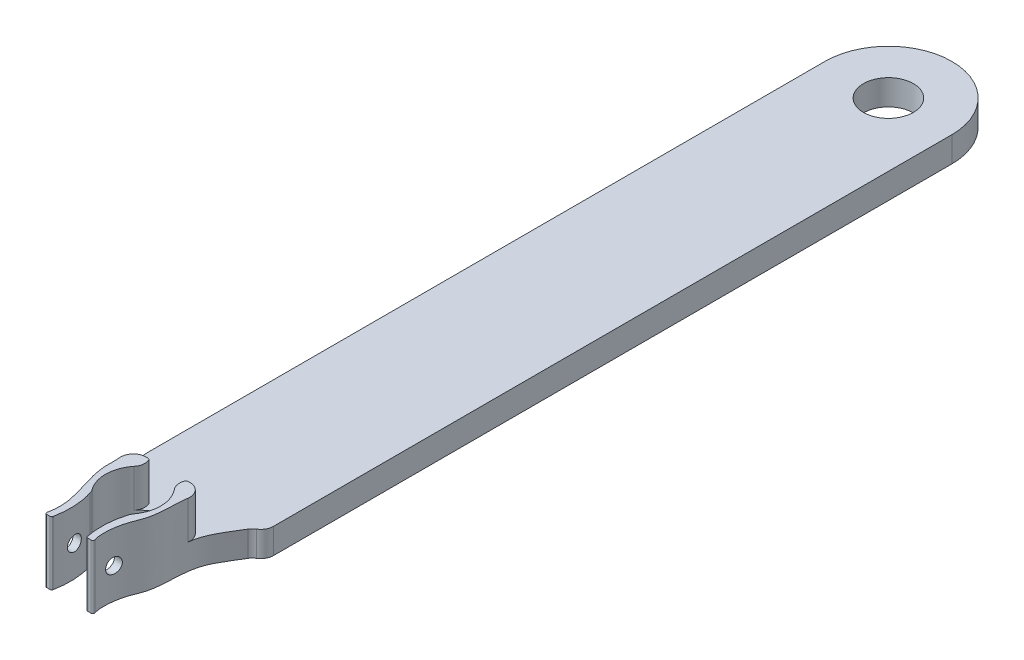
ISO-10303-21;
HEADER;
FILE_DESCRIPTION(('STEP AP214'),'2;1');
FILE_NAME('part.step','',(''),(''),'','','');
FILE_SCHEMA(('AUTOMOTIVE_DESIGN { 1 0 10303 214 1 1 1 1 }'));
ENDSEC;
DATA;
#1=APPLICATION_CONTEXT('core data for automotive mechanical design processes');
#2=APPLICATION_PROTOCOL_DEFINITION('international standard','automotive_design',2000,#1);
#3=PRODUCT_CONTEXT('',#1,'mechanical');
#4=PRODUCT('Part','Part','',(#3));
#5=PRODUCT_RELATED_PRODUCT_CATEGORY('part','',(#4));
#6=PRODUCT_DEFINITION_FORMATION('','',#4);
#7=PRODUCT_DEFINITION_CONTEXT('part definition',#1,'design');
#8=PRODUCT_DEFINITION('design','',#6,#7);
#9=PRODUCT_DEFINITION_SHAPE('','',#8);
#10=(LENGTH_UNIT() NAMED_UNIT(*) SI_UNIT(.MILLI.,.METRE.));
#11=(NAMED_UNIT(*) PLANE_ANGLE_UNIT() SI_UNIT($,.RADIAN.));
#12=(NAMED_UNIT(*) SI_UNIT($,.STERADIAN.) SOLID_ANGLE_UNIT());
#13=UNCERTAINTY_MEASURE_WITH_UNIT(LENGTH_MEASURE(1.E-05),#10,'distance_accuracy_value','');
#14=(GEOMETRIC_REPRESENTATION_CONTEXT(3) GLOBAL_UNCERTAINTY_ASSIGNED_CONTEXT((#13)) GLOBAL_UNIT_ASSIGNED_CONTEXT((#10,
#11,#12)) REPRESENTATION_CONTEXT('',''));
#15=CARTESIAN_POINT('',(0.,0.,0.));
#16=DIRECTION('',(0.,0.,1.));
#17=DIRECTION('',(1.,0.,0.));
#18=AXIS2_PLACEMENT_3D('',#15,#16,#17);
#19=CARTESIAN_POINT('',(-6.93411925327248,12.7,15.7482204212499));
#20=DIRECTION('',(0.,-1.,0.));
#21=DIRECTION('',(0.,0.,-1.));
#22=AXIS2_PLACEMENT_3D('',#19,#20,#21);
#23=PLANE('',#22);
#24=CARTESIAN_POINT('',(4.36822366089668,12.7,14.8654854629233));
#25=DIRECTION('',(0.,-1.,0.));
#26=DIRECTION('',(0.,0.,-1.));
#27=AXIS2_PLACEMENT_3D('',#24,#25,#26);
#28=CIRCLE('',#27,2.54);
#29=CARTESIAN_POINT('',(6.88580314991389,12.7,15.2022250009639));
#30=VERTEX_POINT('',#29);
#31=CARTESIAN_POINT('',(3.65212142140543,12.7,12.4285206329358));
#32=VERTEX_POINT('',#31);
#33=EDGE_CURVE('E447',#30,#32,#28,.F.);
#34=ORIENTED_EDGE('',*,*,#33,.T.);
#35=CARTESIAN_POINT('',(5.96673671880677,12.7,13.4745397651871));
#36=DIRECTION('',(0.,-1.,0.));
#37=DIRECTION('',(0.,0.,-1.));
#38=AXIS2_PLACEMENT_3D('',#35,#36,#37);
#39=CIRCLE('',#38,2.54);
#40=CARTESIAN_POINT('',(3.99752287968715,12.7,15.0788454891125));
#41=VERTEX_POINT('',#40);
#42=EDGE_CURVE('E797',#32,#41,#39,.F.);
#43=ORIENTED_EDGE('',*,*,#42,.T.);
#44=CARTESIAN_POINT('',(-1.25597785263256,12.7,19.3588384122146));
#45=DIRECTION('',(0.,-1.,0.));
#46=DIRECTION('',(0.,0.,-1.));
#47=AXIS2_PLACEMENT_3D('',#44,#45,#46);
#48=CIRCLE('',#47,6.77625334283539);
#49=CARTESIAN_POINT('',(4.21241176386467,12.7,23.3606285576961));
#50=VERTEX_POINT('',#49);
#51=EDGE_CURVE('E369',#41,#50,#48,.T.);
#52=ORIENTED_EDGE('',*,*,#51,.T.);
#53=CARTESIAN_POINT('',(6.26217420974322,12.7,24.8606531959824));
#54=DIRECTION('',(0.,1.,0.));
#55=DIRECTION('',(0.,0.,1.));
#56=AXIS2_PLACEMENT_3D('',#53,#54,#55);
#57=CIRCLE('',#56,2.54);
#58=CARTESIAN_POINT('',(3.83488723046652,12.7,24.1124032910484));
#59=VERTEX_POINT('',#58);
#60=EDGE_CURVE('E371',#50,#59,#57,.T.);
#61=ORIENTED_EDGE('',*,*,#60,.T.);
#62=CARTESIAN_POINT('',(3.83488723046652,12.7,24.1124032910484));
#63=CARTESIAN_POINT('',(3.66684486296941,12.7,24.6575247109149));
#64=CARTESIAN_POINT('',(3.02859140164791,12.7,27.2020407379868));
#65=CARTESIAN_POINT('',(3.03837590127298,12.7,29.8419376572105));
#66=CARTESIAN_POINT('',(3.45189480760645,12.7,31.932369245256));
#67=B_SPLINE_CURVE_WITH_KNOTS('',3,(#62,#63,#64,#65,#66),.UNSPECIFIED.,.F.,.F.,(4,1,4),
(0.0550755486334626,0.252507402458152,0.969570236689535),.UNSPECIFIED.);
#68=CARTESIAN_POINT('',(3.45189480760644,12.7,31.932369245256));
#69=VERTEX_POINT('',#68);
#70=EDGE_CURVE('E373',#59,#69,#67,.T.);
#71=ORIENTED_EDGE('',*,*,#70,.T.);
#72=CARTESIAN_POINT('',(3.77597646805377,12.7,31.8682610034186));
#73=DIRECTION('',(0.,1.,0.));
#74=DIRECTION('',(0.,0.,1.));
#75=AXIS2_PLACEMENT_3D('',#72,#73,#74);
#76=CIRCLE('',#75,0.330361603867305);
#77=CARTESIAN_POINT('',(3.77597646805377,12.7,32.1986226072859));
#78=VERTEX_POINT('',#77);
#79=EDGE_CURVE('E378',#69,#78,#76,.T.);
#80=ORIENTED_EDGE('',*,*,#79,.T.);
#81=DIRECTION('',(1.,0.,0.));
#82=VECTOR('',#81,1.);
#83=CARTESIAN_POINT('',(4.45105676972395,12.7,32.1986226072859));
#84=LINE('',#83,#82);
#85=CARTESIAN_POINT('',(4.45105676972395,12.7,32.1986226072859));
#86=VERTEX_POINT('',#85);
#87=EDGE_CURVE('E623',#78,#86,#84,.T.);
#88=ORIENTED_EDGE('',*,*,#87,.T.);
#89=CARTESIAN_POINT('',(4.45105676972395,12.7,31.8682610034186));
#90=DIRECTION('',(0.,1.,0.));
#91=DIRECTION('',(0.,0.,-1.));
#92=AXIS2_PLACEMENT_3D('',#89,#90,#91);
#93=CIRCLE('',#92,0.330361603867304);
#94=CARTESIAN_POINT('',(4.77346849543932,12.7,31.7962230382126));
#95=VERTEX_POINT('',#94);
#96=EDGE_CURVE('E269',#86,#95,#93,.T.);
#97=ORIENTED_EDGE('',*,*,#96,.T.);
#98=CARTESIAN_POINT('',(4.77346849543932,12.7,31.7962230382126));
#99=CARTESIAN_POINT('',(4.26261652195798,12.7,30.1479997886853));
#100=CARTESIAN_POINT('',(4.52523901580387,12.7,26.6602313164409));
#101=CARTESIAN_POINT('',(7.08560364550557,12.7,20.9954102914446));
#102=CARTESIAN_POINT('',(5.48854782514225,12.7,11.2875043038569));
#103=CARTESIAN_POINT('',(12.8342449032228,12.7,5.63803468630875));
#104=CARTESIAN_POINT('',(12.6900757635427,12.7,0.501973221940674));
#105=B_SPLINE_CURVE_WITH_KNOTS('',3,(#98,#99,#100,#101,#102,#103,#104),.UNSPECIFIED.,.F.,.F.,(4,
1,1,1,4),(0.,0.239032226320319,0.296991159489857,0.579589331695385,1.),.UNSPECIFIED.);
#106=EDGE_CURVE('E264',#95,#30,#105,.T.);
#107=ORIENTED_EDGE('',*,*,#106,.T.);
#108=EDGE_LOOP('',(#34,#43,#52,#61,#71,#80,#88,#97,#107));
#109=FACE_BOUND('',#108,.T.);
#110=ADVANCED_FACE('F33',(#109),#23,.F.);
#111=CARTESIAN_POINT('',(1.25597785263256,12.7,19.3588384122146));
#112=DIRECTION('',(0.,-1.,0.));
#113=DIRECTION('',(0.,0.,1.));
#114=AXIS2_PLACEMENT_3D('',#111,#112,#113);
#115=CIRCLE('',#114,6.77625334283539);
#116=CARTESIAN_POINT('',(-4.21241176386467,12.7,23.3606285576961));
#117=VERTEX_POINT('',#116);
#118=CARTESIAN_POINT('',(-4.02602229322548,12.7,15.1140670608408));
#119=VERTEX_POINT('',#118);
#120=EDGE_CURVE('E366',#117,#119,#115,.T.);
#121=ORIENTED_EDGE('',*,*,#120,.T.);
#122=CARTESIAN_POINT('',(-6.00591880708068,12.7,13.5229637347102));
#123=DIRECTION('',(0.,-1.,0.));
#124=DIRECTION('',(0.,0.,-1.));
#125=AXIS2_PLACEMENT_3D('',#122,#123,#124);
#126=CIRCLE('',#125,2.54);
#127=CARTESIAN_POINT('',(-3.7241393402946,12.7,12.4071311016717));
#128=VERTEX_POINT('',#127);
#129=EDGE_CURVE('E55',#119,#128,#126,.F.);
#130=ORIENTED_EDGE('',*,*,#129,.T.);
#131=CARTESIAN_POINT('',(-4.45436274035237,12.7,14.8399019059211));
#132=DIRECTION('',(0.,-1.,0.));
#133=DIRECTION('',(0.,0.,-1.));
#134=AXIS2_PLACEMENT_3D('',#131,#132,#133);
#135=CIRCLE('',#134,2.54);
#136=CARTESIAN_POINT('',(-6.97942797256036,12.7,15.1149393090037));
#137=VERTEX_POINT('',#136);
#138=EDGE_CURVE('E418',#128,#137,#135,.F.);
#139=ORIENTED_EDGE('',*,*,#138,.T.);
#140=CARTESIAN_POINT('',(-12.6900757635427,12.7,0.50197322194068));
#141=CARTESIAN_POINT('',(-12.7085946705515,12.7,0.534595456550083));
#142=CARTESIAN_POINT('',(-12.9445111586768,12.7,3.81873144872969));
#143=CARTESIAN_POINT('',(-6.44251711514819,12.7,13.8864500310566));
#144=CARTESIAN_POINT('',(-7.36026092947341,12.7,18.4591788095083));
#145=CARTESIAN_POINT('',(-5.27387900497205,12.7,24.7590934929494));
#146=CARTESIAN_POINT('',(-4.15604476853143,12.7,29.0328933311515));
#147=CARTESIAN_POINT('',(-4.77346849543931,12.7,31.7962230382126));
#148=B_SPLINE_CURVE_WITH_KNOTS('',3,(#140,#141,#142,#143,#144,#145,#146,#147),.UNSPECIFIED.,.F.,
.F.,(4,1,1,1,1,4),(0.,0.279659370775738,0.433863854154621,0.566787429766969,0.759908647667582,
0.988953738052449),.UNSPECIFIED.);
#149=CARTESIAN_POINT('',(-4.77346849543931,12.7,31.7962230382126));
#150=VERTEX_POINT('',#149);
#151=EDGE_CURVE('E443',#137,#150,#148,.T.);
#152=ORIENTED_EDGE('',*,*,#151,.T.);
#153=CARTESIAN_POINT('',(-4.45105676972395,12.7,31.8682610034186));
#154=DIRECTION('',(0.,1.,0.));
#155=DIRECTION('',(0.,0.,1.));
#156=AXIS2_PLACEMENT_3D('',#153,#154,#155);
#157=CIRCLE('',#156,0.330361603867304);
#158=CARTESIAN_POINT('',(-4.45105676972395,12.7,32.1986226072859));
#159=VERTEX_POINT('',#158);
#160=EDGE_CURVE('E438',#150,#159,#157,.T.);
#161=ORIENTED_EDGE('',*,*,#160,.T.);
#162=DIRECTION('',(1.,0.,0.));
#163=VECTOR('',#162,1.);
#164=CARTESIAN_POINT('',(-4.45105676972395,12.7,32.1986226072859));
#165=LINE('',#164,#163);
#166=CARTESIAN_POINT('',(-3.77597646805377,12.7,32.1986226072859));
#167=VERTEX_POINT('',#166);
#168=EDGE_CURVE('E834',#159,#167,#165,.T.);
#169=ORIENTED_EDGE('',*,*,#168,.T.);
#170=CARTESIAN_POINT('',(-3.77597646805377,12.7,31.8682610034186));
#171=DIRECTION('',(0.,1.,0.));
#172=DIRECTION('',(0.,0.,-1.));
#173=AXIS2_PLACEMENT_3D('',#170,#171,#172);
#174=CIRCLE('',#173,0.330361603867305);
#175=CARTESIAN_POINT('',(-3.45189480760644,12.7,31.932369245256));
#176=VERTEX_POINT('',#175);
#177=EDGE_CURVE('E360',#167,#176,#174,.T.);
#178=ORIENTED_EDGE('',*,*,#177,.T.);
#179=CARTESIAN_POINT('',(-3.45189480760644,12.7,31.932369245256));
#180=CARTESIAN_POINT('',(-3.03837590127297,12.7,29.8419376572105));
#181=CARTESIAN_POINT('',(-3.0285914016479,12.7,27.2020407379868));
#182=CARTESIAN_POINT('',(-3.6668448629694,12.7,24.6575247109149));
#183=CARTESIAN_POINT('',(-3.83488723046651,12.7,24.1124032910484));
#184=B_SPLINE_CURVE_WITH_KNOTS('',3,(#179,#180,#181,#182,#183),.UNSPECIFIED.,.F.,.F.,(4,1,4),
(0.0550755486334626,0.772138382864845,0.969570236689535),.UNSPECIFIED.);
#185=CARTESIAN_POINT('',(-3.83488723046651,12.7,24.1124032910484));
#186=VERTEX_POINT('',#185);
#187=EDGE_CURVE('E353',#176,#186,#184,.T.);
#188=ORIENTED_EDGE('',*,*,#187,.T.);
#189=CARTESIAN_POINT('',(-6.26217420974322,12.7,24.8606531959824));
#190=DIRECTION('',(0.,1.,0.));
#191=DIRECTION('',(0.,0.,-1.));
#192=AXIS2_PLACEMENT_3D('',#189,#190,#191);
#193=CIRCLE('',#192,2.54);
#194=EDGE_CURVE('E359',#186,#117,#193,.T.);
#195=ORIENTED_EDGE('',*,*,#194,.T.);
#196=EDGE_LOOP('',(#121,#130,#139,#152,#161,#169,#178,#188,#195));
#197=FACE_BOUND('',#196,.T.);
#198=ADVANCED_FACE('F395',(#197),#23,.F.);
#199=CARTESIAN_POINT('',(1.25597785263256,12.7,19.3588384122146));
#200=DIRECTION('',(0.,-1.,0.));
#201=DIRECTION('',(0.,0.,-1.));
#202=AXIS2_PLACEMENT_3D('',#199,#200,#201);
#203=CYLINDRICAL_SURFACE('',#202,6.77625334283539);
#204=CARTESIAN_POINT('',(1.25597785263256,5.08,19.3588384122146));
#205=DIRECTION('',(0.,-1.,0.));
#206=DIRECTION('',(0.,0.,-1.));
#207=AXIS2_PLACEMENT_3D('',#204,#205,#206);
#208=CIRCLE('',#207,6.77625334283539);
#209=CARTESIAN_POINT('',(-4.02602229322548,5.08,15.1140670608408));
#210=VERTEX_POINT('',#209);
#211=CARTESIAN_POINT('',(0.,5.08,12.7));
#212=VERTEX_POINT('',#211);
#213=EDGE_CURVE('E48',#210,#212,#208,.T.);
#214=ORIENTED_EDGE('',*,*,#213,.F.);
#215=DIRECTION('',(0.,-1.,0.));
#216=VECTOR('',#215,1.);
#217=CARTESIAN_POINT('',(-4.02602229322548,12.7,15.1140670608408));
#218=LINE('',#217,#216);
#219=EDGE_CURVE('E795',#210,#119,#218,.F.);
#220=ORIENTED_EDGE('',*,*,#219,.T.);
#221=ORIENTED_EDGE('',*,*,#120,.F.);
#222=DIRECTION('',(0.,-1.,0.));
#223=VECTOR('',#222,1.);
#224=CARTESIAN_POINT('',(-4.21241176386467,12.7,23.3606285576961));
#225=LINE('',#224,#223);
#226=CARTESIAN_POINT('',(-4.21241176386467,0.,23.3606285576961));
#227=VERTEX_POINT('',#226);
#228=EDGE_CURVE('E239',#117,#227,#225,.T.);
#229=ORIENTED_EDGE('',*,*,#228,.T.);
#230=CARTESIAN_POINT('',(1.25597785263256,0.,19.3588384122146));
#231=DIRECTION('',(0.,-1.,0.));
#232=DIRECTION('',(0.,0.,1.));
#233=AXIS2_PLACEMENT_3D('',#230,#231,#232);
#234=CIRCLE('',#233,6.77625334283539);
#235=CARTESIAN_POINT('',(0.,0.,12.7));
#236=VERTEX_POINT('',#235);
#237=EDGE_CURVE('E237',#227,#236,#234,.T.);
#238=ORIENTED_EDGE('',*,*,#237,.T.);
#239=DIRECTION('',(0.,-1.,0.));
#240=VECTOR('',#239,1.);
#241=CARTESIAN_POINT('',(0.,12.7,12.7));
#242=LINE('',#241,#240);
#243=EDGE_CURVE('E228',#212,#236,#242,.T.);
#244=ORIENTED_EDGE('',*,*,#243,.F.);
#245=EDGE_LOOP('',(#214,#220,#221,#229,#238,#244));
#246=FACE_BOUND('',#245,.T.);
#247=ADVANCED_FACE('F234',(#246),#203,.F.);
#248=CARTESIAN_POINT('',(-1.25597785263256,12.7,19.3588384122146));
#249=DIRECTION('',(0.,-1.,0.));
#250=DIRECTION('',(0.,0.,-1.));
#251=AXIS2_PLACEMENT_3D('',#248,#249,#250);
#252=CYLINDRICAL_SURFACE('',#251,6.77625334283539);
#253=ORIENTED_EDGE('',*,*,#51,.F.);
#254=DIRECTION('',(0.,-1.,0.));
#255=VECTOR('',#254,1.);
#256=CARTESIAN_POINT('',(3.99752287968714,12.7,15.0788454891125));
#257=LINE('',#256,#255);
#258=CARTESIAN_POINT('',(3.99752287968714,5.08,15.0788454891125));
#259=VERTEX_POINT('',#258);
#260=EDGE_CURVE('E231',#41,#259,#257,.T.);
#261=ORIENTED_EDGE('',*,*,#260,.T.);
#262=CARTESIAN_POINT('',(-1.25597785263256,5.08,19.3588384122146));
#263=DIRECTION('',(0.,-1.,0.));
#264=DIRECTION('',(0.,0.,-1.));
#265=AXIS2_PLACEMENT_3D('',#262,#263,#264);
#266=CIRCLE('',#265,6.77625334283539);
#267=EDGE_CURVE('E219',#212,#259,#266,.T.);
#268=ORIENTED_EDGE('',*,*,#267,.F.);
#269=ORIENTED_EDGE('',*,*,#243,.T.);
#270=CARTESIAN_POINT('',(-1.25597785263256,0.,19.3588384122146));
#271=DIRECTION('',(0.,-1.,0.));
#272=DIRECTION('',(0.,0.,-1.));
#273=AXIS2_PLACEMENT_3D('',#270,#271,#272);
#274=CIRCLE('',#273,6.77625334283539);
#275=CARTESIAN_POINT('',(4.21241176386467,0.,23.3606285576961));
#276=VERTEX_POINT('',#275);
#277=EDGE_CURVE('E608',#236,#276,#274,.T.);
#278=ORIENTED_EDGE('',*,*,#277,.T.);
#279=DIRECTION('',(0.,-1.,0.));
#280=VECTOR('',#279,1.);
#281=CARTESIAN_POINT('',(4.21241176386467,12.7,23.3606285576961));
#282=LINE('',#281,#280);
#283=EDGE_CURVE('E240',#50,#276,#282,.T.);
#284=ORIENTED_EDGE('',*,*,#283,.F.);
#285=EDGE_LOOP('',(#253,#261,#268,#269,#278,#284));
#286=FACE_BOUND('',#285,.T.);
#287=ADVANCED_FACE('F227',(#286),#252,.F.);
#288=DIRECTION('',(0.,-1.,0.));
#289=VECTOR('',#288,1.);
#290=SURFACE_OF_LINEAR_EXTRUSION('',#148,#289);
#291=CARTESIAN_POINT('',(-4.9115509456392,6.19166393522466,26.4076961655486));
#292=CARTESIAN_POINT('',(-4.91154909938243,6.27297076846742,26.40770191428));
#293=CARTESIAN_POINT('',(-4.90996669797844,6.35435610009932,26.4144616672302));
#294=CARTESIAN_POINT('',(-4.90529799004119,6.4745938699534,26.4345448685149));
#295=CARTESIAN_POINT('',(-4.90335681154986,6.51439690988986,26.4429069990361));
#296=CARTESIAN_POINT('',(-4.89873847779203,6.5931734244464,26.4628836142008));
#297=CARTESIAN_POINT('',(-4.89606071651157,6.6321461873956,26.4745007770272));
#298=CARTESIAN_POINT('',(-4.88698976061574,6.74719886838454,26.5140537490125));
#299=CARTESIAN_POINT('',(-4.87955052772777,6.82162223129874,26.5467263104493));
#300=CARTESIAN_POINT('',(-4.8623080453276,6.9638904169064,26.6237052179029));
#301=CARTESIAN_POINT('',(-4.85250436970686,7.03173405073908,26.6680136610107));
#302=CARTESIAN_POINT('',(-4.8363756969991,7.12765417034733,26.7425131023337));
#303=CARTESIAN_POINT('',(-4.83071577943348,7.15885838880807,26.7689078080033));
#304=CARTESIAN_POINT('',(-4.8190168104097,7.21890236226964,26.8241267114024));
#305=CARTESIAN_POINT('',(-4.81297813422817,7.24774439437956,26.8529485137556));
#306=CARTESIAN_POINT('',(-4.79440173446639,7.33051253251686,26.942830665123));
#307=CARTESIAN_POINT('',(-4.78140123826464,7.38069471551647,27.0073186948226));
#308=CARTESIAN_POINT('',(-4.75457439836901,7.47069043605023,27.1451352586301));
#309=CARTESIAN_POINT('',(-4.74073598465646,7.51024154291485,27.2186318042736));
#310=CARTESIAN_POINT('',(-4.71322895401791,7.57641103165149,27.371278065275));
#311=CARTESIAN_POINT('',(-4.69956034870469,7.60302853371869,27.4504281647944));
#312=CARTESIAN_POINT('',(-4.67294654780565,7.64272049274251,27.612924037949));
#313=CARTESIAN_POINT('',(-4.66000866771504,7.65567529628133,27.6963002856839));
#314=CARTESIAN_POINT('',(-4.63555867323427,7.66717199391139,27.8642495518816));
#315=CARTESIAN_POINT('',(-4.62404647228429,7.66571476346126,27.9488224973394));
#316=CARTESIAN_POINT('',(-4.60295968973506,7.64840199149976,28.1158727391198));
#317=CARTESIAN_POINT('',(-4.59336709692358,7.63268877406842,28.1983624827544));
#318=CARTESIAN_POINT('',(-4.57617953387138,7.58741182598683,28.3596668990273));
#319=CARTESIAN_POINT('',(-4.56858439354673,7.55784927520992,28.4384818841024));
#320=CARTESIAN_POINT('',(-4.55548169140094,7.48619670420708,28.5889539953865));
#321=CARTESIAN_POINT('',(-4.54994517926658,7.44429653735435,28.6606990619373));
#322=CARTESIAN_POINT('',(-4.54062061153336,7.34898073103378,28.7962088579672));
#323=CARTESIAN_POINT('',(-4.53683250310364,7.29556543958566,28.8599738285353));
#324=CARTESIAN_POINT('',(-4.53070857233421,7.17907585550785,28.9773139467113));
#325=CARTESIAN_POINT('',(-4.52836453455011,7.11605879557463,29.030945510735));
#326=CARTESIAN_POINT('',(-4.52472223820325,6.98192657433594,29.1269316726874));
#327=CARTESIAN_POINT('',(-4.52342398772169,6.9108113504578,29.1692861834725));
#328=CARTESIAN_POINT('',(-4.52150521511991,6.76236052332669,29.2415768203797));
#329=CARTESIAN_POINT('',(-4.52088591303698,6.68501398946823,29.2714905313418));
#330=CARTESIAN_POINT('',(-4.52003073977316,6.52640130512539,29.3179411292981));
#331=CARTESIAN_POINT('',(-4.51979487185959,6.44513512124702,29.3344779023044));
#332=CARTESIAN_POINT('',(-4.51952753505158,6.28082104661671,29.3537250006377));
#333=CARTESIAN_POINT('',(-4.51949646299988,6.1977700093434,29.3564084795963));
#334=CARTESIAN_POINT('',(-4.51960969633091,6.03239515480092,29.3478002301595));
#335=CARTESIAN_POINT('',(-4.51975400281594,5.95007134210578,29.3365084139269));
#336=CARTESIAN_POINT('',(-4.52034278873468,5.78846022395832,29.300264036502));
#337=CARTESIAN_POINT('',(-4.52078736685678,5.70917392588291,29.2753069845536));
#338=CARTESIAN_POINT('',(-4.52223629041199,5.55591971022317,29.2124393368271));
#339=CARTESIAN_POINT('',(-4.52324063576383,5.48195179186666,29.1745287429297));
#340=CARTESIAN_POINT('',(-4.5261595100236,5.34148246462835,29.086864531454));
#341=CARTESIAN_POINT('',(-4.5280735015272,5.27497667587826,29.0371179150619));
#342=CARTESIAN_POINT('',(-4.53319348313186,5.15127834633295,28.9272045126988));
#343=CARTESIAN_POINT('',(-4.53639944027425,5.0940855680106,28.8670379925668));
#344=CARTESIAN_POINT('',(-4.54443757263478,4.99075986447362,28.7381890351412));
#345=CARTESIAN_POINT('',(-4.54926588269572,4.94460109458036,28.6695270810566));
#346=CARTESIAN_POINT('',(-4.56078627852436,4.86445348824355,28.5255795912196));
#347=CARTESIAN_POINT('',(-4.56747832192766,4.8304643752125,28.4502942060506));
#348=CARTESIAN_POINT('',(-4.58279750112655,4.77557787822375,28.2953464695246));
#349=CARTESIAN_POINT('',(-4.59142319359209,4.75467077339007,28.2156874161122));
#350=CARTESIAN_POINT('',(-4.6105019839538,4.72640023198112,28.0542171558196));
#351=CARTESIAN_POINT('',(-4.62095516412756,4.71903740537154,27.9724058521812));
#352=CARTESIAN_POINT('',(-4.6434844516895,4.71795066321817,27.8082322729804));
#353=CARTESIAN_POINT('',(-4.65557318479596,4.72433927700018,27.725870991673));
#354=CARTESIAN_POINT('',(-4.68083322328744,4.75070334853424,27.5635338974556));
#355=CARTESIAN_POINT('',(-4.69400463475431,4.77068013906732,27.4835583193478));
#356=CARTESIAN_POINT('',(-4.72104507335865,4.8240558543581,27.326903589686));
#357=CARTESIAN_POINT('',(-4.73492164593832,4.85765352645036,27.2502927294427));
#358=CARTESIAN_POINT('',(-4.75556502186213,4.91734037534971,27.1405186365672));
#359=CARTESIAN_POINT('',(-4.76241891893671,4.93878959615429,27.1047776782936));
#360=CARTESIAN_POINT('',(-4.77599043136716,4.98467301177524,27.0351836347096));
#361=CARTESIAN_POINT('',(-4.78270789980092,5.00911024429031,27.0013325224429));
#362=CARTESIAN_POINT('',(-4.8025875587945,5.08696696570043,26.9026301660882));
#363=CARTESIAN_POINT('',(-4.81539879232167,5.14470826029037,26.8410403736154));
#364=CARTESIAN_POINT('',(-4.83932221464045,5.27005433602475,26.7284874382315));
#365=CARTESIAN_POINT('',(-4.85043468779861,5.3376574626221,26.6775225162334));
#366=CARTESIAN_POINT('',(-4.8652683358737,5.44455227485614,26.610506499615));
#367=CARTESIAN_POINT('',(-4.86988675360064,5.48088611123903,26.5898273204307));
#368=CARTESIAN_POINT('',(-4.87847622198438,5.55520180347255,26.5516181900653));
#369=CARTESIAN_POINT('',(-4.88244783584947,5.59318218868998,26.5340854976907));
#370=CARTESIAN_POINT('',(-4.89329408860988,5.70918895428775,26.4864432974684));
#371=CARTESIAN_POINT('',(-4.89911801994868,5.78940823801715,26.4612098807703));
#372=CARTESIAN_POINT('',(-4.90605727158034,5.92371458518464,26.4312650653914));
#373=CARTESIAN_POINT('',(-4.90811162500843,5.97688912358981,26.4224418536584));
#374=CARTESIAN_POINT('',(-4.91085906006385,6.08391893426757,26.4106555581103));
#375=CARTESIAN_POINT('',(-4.9115521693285,6.13777419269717,26.4076923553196));
#376=CARTESIAN_POINT('',(-4.9115509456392,6.19166393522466,26.4076961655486));
#377=B_SPLINE_CURVE_WITH_KNOTS('',3,(#291,#292,#293,#294,#295,#296,#297,#298,#299,#300,#301,
#302,#303,#304,#305,#306,#307,#308,#309,#310,#311,#312,#313,#314,#315,#316,#317,#318,#319,#320,
#321,#322,#323,#324,#325,#326,#327,#328,#329,#330,#331,#332,#333,#334,#335,#336,#337,#338,#339,
#340,#341,#342,#343,#344,#345,#346,#347,#348,#349,#350,#351,#352,#353,#354,#355,#356,#357,#358,
#359,#360,#361,#362,#363,#364,#365,#366,#367,#368,#369,#370,#371,#372,#373,#374,#375,#376),
.UNSPECIFIED.,.T.,.F.,(4,2,2,2,2,2,2,2,2,2,2,2,2,2,2,2,2,2,2,2,2,2,2,2,2,2,2,2,2,2,2,2,2,2,2,2,
2,2,2,2,2,2,4),(0.,0.243688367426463,0.365724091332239,0.487860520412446,0.731505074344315,
0.97519356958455,1.09885026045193,1.22238630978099,1.4694052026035,1.72205493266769,
1.97472184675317,2.22958361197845,2.48442989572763,2.73675959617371,2.98906780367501,
3.23768005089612,3.48628478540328,3.73346179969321,3.98064072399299,4.22826309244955,
4.4758875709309,4.72399174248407,4.97209747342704,5.22028478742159,5.4684720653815,
5.71651290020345,5.96454740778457,6.21199512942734,6.45943722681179,6.70669523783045,
6.95396438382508,7.20326464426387,7.45258936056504,7.70569109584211,7.83229256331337,
7.95902382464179,8.213889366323,8.46871219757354,8.59475621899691,8.72068989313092,
8.97210920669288,9.1336278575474,9.295143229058),.UNSPECIFIED.);
#378=CARTESIAN_POINT('',(-4.9115509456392,6.19166393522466,26.4076961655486));
#379=VERTEX_POINT('',#378);
#380=EDGE_CURVE('E315',#379,#379,#377,.T.);
#381=ORIENTED_EDGE('',*,*,#380,.T.);
#382=EDGE_LOOP('',(#381));
#383=FACE_BOUND('',#382,.T.);
#384=ORIENTED_EDGE('',*,*,#151,.F.);
#385=DIRECTION('',(0.,-1.,0.));
#386=VECTOR('',#385,1.);
#387=CARTESIAN_POINT('',(-6.97942797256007,12.7,15.1149393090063));
#388=LINE('',#387,#386);
#389=CARTESIAN_POINT('',(-6.97942797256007,5.08,15.1149393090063));
#390=VERTEX_POINT('',#389);
#391=EDGE_CURVE('E417',#137,#390,#388,.T.);
#392=ORIENTED_EDGE('',*,*,#391,.T.);
#393=CARTESIAN_POINT('',(-6.97942797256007,5.08,15.1149393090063));
#394=CARTESIAN_POINT('',(-6.98819792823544,5.08,15.0343324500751));
#395=CARTESIAN_POINT('',(-6.9982056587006,5.08,14.9538584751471));
#396=CARTESIAN_POINT('',(-7.02074471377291,5.08,14.7932653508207));
#397=CARTESIAN_POINT('',(-7.03327602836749,5.08,14.713146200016));
#398=CARTESIAN_POINT('',(-7.06077098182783,5.08,14.5541571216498));
#399=CARTESIAN_POINT('',(-7.07570880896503,5.08,14.4752827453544));
#400=CARTESIAN_POINT('',(-7.10808905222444,5.08,14.3180539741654));
#401=CARTESIAN_POINT('',(-7.12553146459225,5.08,14.2396995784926));
#402=CARTESIAN_POINT('',(-7.18131969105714,5.08,14.006463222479));
#403=CARTESIAN_POINT('',(-7.22329658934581,5.08,13.8524293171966));
#404=CARTESIAN_POINT('',(-7.29301123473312,5.08,13.6236780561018));
#405=CARTESIAN_POINT('',(-7.31734272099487,5.08,13.5478961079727));
#406=CARTESIAN_POINT('',(-7.36804467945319,5.08,13.3970150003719));
#407=CARTESIAN_POINT('',(-7.3944151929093,5.08,13.3219158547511));
#408=CARTESIAN_POINT('',(-7.47608551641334,5.08,13.097575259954));
#409=CARTESIAN_POINT('',(-7.53395114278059,5.08,12.9492681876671));
#410=CARTESIAN_POINT('',(-7.65483030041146,5.08,12.6546749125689));
#411=CARTESIAN_POINT('',(-7.71784734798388,5.08,12.5083901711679));
#412=CARTESIAN_POINT('',(-7.84737603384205,5.08,12.2185331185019));
#413=CARTESIAN_POINT('',(-7.91386207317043,5.08,12.0749493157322));
#414=CARTESIAN_POINT('',(-8.05000402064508,5.08,11.7888841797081));
#415=CARTESIAN_POINT('',(-8.11966702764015,5.08,11.646406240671));
#416=CARTESIAN_POINT('',(-8.26155684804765,5.08,11.362237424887));
#417=CARTESIAN_POINT('',(-8.3337903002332,5.08,11.220549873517));
#418=CARTESIAN_POINT('',(-8.48033185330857,5.08,10.9377090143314));
#419=CARTESIAN_POINT('',(-8.55464558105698,5.08,10.7965586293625));
#420=CARTESIAN_POINT('',(-8.70493254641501,5.08,10.5145786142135));
#421=CARTESIAN_POINT('',(-8.780910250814,5.08,10.3737513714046));
#422=CARTESIAN_POINT('',(-8.93417063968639,5.08,10.0922334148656));
#423=CARTESIAN_POINT('',(-9.01145667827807,5.08,9.95154452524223));
#424=CARTESIAN_POINT('',(-9.08909175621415,5.08,9.81105223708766));
#425=B_SPLINE_CURVE_WITH_KNOTS('',3,(#393,#394,#395,#396,#397,#398,#399,#400,#401,#402,#403,
#404,#405,#406,#407,#408,#409,#410,#411,#412,#413,#414,#415,#416,#417,#418,#419,#420,#421,#422,
#423,#424),.UNSPECIFIED.,.F.,.F.,(4,2,2,2,2,2,2,2,2,2,2,2,2,2,2,4),(0.,0.243240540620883,
0.48648011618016,0.727265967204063,0.968051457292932,1.4466472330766,1.68540061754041,
1.92415883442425,2.40160472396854,2.87937927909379,3.35402376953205,3.82978646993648,
4.30688267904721,4.78542560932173,5.26546660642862,5.74701817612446),.UNSPECIFIED.);
#426=CARTESIAN_POINT('',(-7.74292579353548,5.08,12.4529571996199));
#427=VERTEX_POINT('',#426);
#428=EDGE_CURVE('E411',#390,#427,#425,.T.);
#429=ORIENTED_EDGE('',*,*,#428,.T.);
#430=CARTESIAN_POINT('',(-12.6900757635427,5.08,0.50197322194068));
#431=CARTESIAN_POINT('',(-12.7085946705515,5.08,0.534595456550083));
#432=CARTESIAN_POINT('',(-12.9445111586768,5.08,3.81873144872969));
#433=CARTESIAN_POINT('',(-6.44251711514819,5.08,13.8864500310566));
#434=CARTESIAN_POINT('',(-7.36026092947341,5.08,18.4591788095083));
#435=CARTESIAN_POINT('',(-5.27387900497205,5.08,24.7590934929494));
#436=CARTESIAN_POINT('',(-4.15604476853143,5.08,29.0328933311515));
#437=CARTESIAN_POINT('',(-4.77346849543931,5.08,31.7962230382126));
#438=B_SPLINE_CURVE_WITH_KNOTS('',3,(#430,#431,#432,#433,#434,#435,#436,#437),.UNSPECIFIED.,.F.,
.F.,(4,1,1,1,1,4),(0.,0.279659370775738,0.433863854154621,0.566787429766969,0.759908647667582,
0.988953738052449),.UNSPECIFIED.);
#439=CARTESIAN_POINT('',(-10.6093893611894,5.08,7.06233555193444));
#440=VERTEX_POINT('',#439);
#441=EDGE_CURVE('E479',#440,#427,#438,.T.);
#442=ORIENTED_EDGE('',*,*,#441,.F.);
#443=DIRECTION('',(0.,-1.,0.));
#444=VECTOR('',#443,1.);
#445=CARTESIAN_POINT('',(-10.6093893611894,5.08,7.06233555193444));
#446=LINE('',#445,#444);
#447=CARTESIAN_POINT('',(-10.6093893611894,0.,7.06233555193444));
#448=VERTEX_POINT('',#447);
#449=EDGE_CURVE('E475',#440,#448,#446,.T.);
#450=ORIENTED_EDGE('',*,*,#449,.T.);
#451=CARTESIAN_POINT('',(-12.6900757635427,0.,0.50197322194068));
#452=CARTESIAN_POINT('',(-12.7085946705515,0.,0.534595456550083));
#453=CARTESIAN_POINT('',(-12.9445111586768,0.,3.81873144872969));
#454=CARTESIAN_POINT('',(-6.44251711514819,0.,13.8864500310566));
#455=CARTESIAN_POINT('',(-7.36026092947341,0.,18.4591788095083));
#456=CARTESIAN_POINT('',(-5.27387900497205,0.,24.7590934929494));
#457=CARTESIAN_POINT('',(-4.15604476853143,0.,29.0328933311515));
#458=CARTESIAN_POINT('',(-4.77346849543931,0.,31.7962230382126));
#459=B_SPLINE_CURVE_WITH_KNOTS('',3,(#451,#452,#453,#454,#455,#456,#457,#458),.UNSPECIFIED.,.F.,
.F.,(4,1,1,1,1,4),(0.,0.279659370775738,0.433863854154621,0.566787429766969,0.759908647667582,
0.988953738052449),.UNSPECIFIED.);
#460=CARTESIAN_POINT('',(-4.77346849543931,0.,31.7962230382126));
#461=VERTEX_POINT('',#460);
#462=EDGE_CURVE('E278',#448,#461,#459,.T.);
#463=ORIENTED_EDGE('',*,*,#462,.T.);
#464=DIRECTION('',(0.,-1.,0.));
#465=VECTOR('',#464,1.);
#466=CARTESIAN_POINT('',(-4.77346849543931,12.7,31.7962230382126));
#467=LINE('',#466,#465);
#468=EDGE_CURVE('E260',#150,#461,#467,.T.);
#469=ORIENTED_EDGE('',*,*,#468,.F.);
#470=EDGE_LOOP('',(#384,#392,#429,#442,#450,#463,#469));
#471=FACE_BOUND('',#470,.T.);
#472=ADVANCED_FACE('F293',(#383,#471),#290,.F.);
#473=DIRECTION('',(0.,-1.,0.));
#474=VECTOR('',#473,1.);
#475=SURFACE_OF_LINEAR_EXTRUSION('',#105,#474);
#476=CARTESIAN_POINT('',(4.91114179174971,6.19166393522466,26.4076961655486));
#477=CARTESIAN_POINT('',(4.91113965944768,6.1104523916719,26.4077019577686));
#478=CARTESIAN_POINT('',(4.90948330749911,6.02916161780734,26.4144462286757));
#479=CARTESIAN_POINT('',(4.90460866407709,5.90906740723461,26.4344810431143));
#480=CARTESIAN_POINT('',(4.90258286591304,5.86931211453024,26.4428229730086));
#481=CARTESIAN_POINT('',(4.89776997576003,5.79063145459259,26.4627501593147));
#482=CARTESIAN_POINT('',(4.89498226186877,5.75170679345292,26.474338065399));
#483=CARTESIAN_POINT('',(4.8855553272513,5.63680491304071,26.5137863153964));
#484=CARTESIAN_POINT('',(4.87784317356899,5.56248272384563,26.5463677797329));
#485=CARTESIAN_POINT('',(4.86005023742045,5.42039570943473,26.6231255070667));
#486=CARTESIAN_POINT('',(4.84996899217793,5.35263216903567,26.6673040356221));
#487=CARTESIAN_POINT('',(4.83345255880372,5.25674844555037,26.7416303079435));
#488=CARTESIAN_POINT('',(4.82766192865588,5.22551870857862,26.7679960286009));
#489=CARTESIAN_POINT('',(4.81571880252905,5.16542063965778,26.8231602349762));
#490=CARTESIAN_POINT('',(4.80956666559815,5.13655003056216,26.8519563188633));
#491=CARTESIAN_POINT('',(4.79068151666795,5.05369088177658,26.9417681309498));
#492=CARTESIAN_POINT('',(4.77751731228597,5.00344103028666,27.0062182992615));
#493=CARTESIAN_POINT('',(4.75043570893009,4.9132633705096,27.144038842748));
#494=CARTESIAN_POINT('',(4.73650786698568,4.87360710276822,27.2175838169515));
#495=CARTESIAN_POINT('',(4.70887686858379,4.80725018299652,27.3703577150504));
#496=CARTESIAN_POINT('',(4.69517372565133,4.78055030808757,27.449586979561));
#497=CARTESIAN_POINT('',(4.66849965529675,4.7407459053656,27.6121709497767));
#498=CARTESIAN_POINT('',(4.65553511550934,4.72774671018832,27.6955525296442));
#499=CARTESIAN_POINT('',(4.63095503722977,4.71616395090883,27.8635098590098));
#500=CARTESIAN_POINT('',(4.61933942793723,4.71757962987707,27.9480855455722));
#501=CARTESIAN_POINT('',(4.59791135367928,4.73481163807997,28.115176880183));
#502=CARTESIAN_POINT('',(4.58808299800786,4.75049277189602,28.1977044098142));
#503=CARTESIAN_POINT('',(4.57027757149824,4.79571337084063,28.3590805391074));
#504=CARTESIAN_POINT('',(4.56230035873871,4.82525177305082,28.4379294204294));
#505=CARTESIAN_POINT('',(4.54830457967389,4.89691181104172,28.5885679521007));
#506=CARTESIAN_POINT('',(4.5422612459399,4.93885988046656,28.6604379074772));
#507=CARTESIAN_POINT('',(4.53185555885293,5.03431363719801,28.7961785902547));
#508=CARTESIAN_POINT('',(4.52749314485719,5.08781890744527,28.8600496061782));
#509=CARTESIAN_POINT('',(4.52022624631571,5.20449216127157,28.9775370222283));
#510=CARTESIAN_POINT('',(4.51731267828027,5.26759661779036,29.0312159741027));
#511=CARTESIAN_POINT('',(4.51259762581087,5.4019265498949,29.1272712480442));
#512=CARTESIAN_POINT('',(4.51079614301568,5.47315203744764,29.1696475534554));
#513=CARTESIAN_POINT('',(4.50799490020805,5.62173703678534,29.2418991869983));
#514=CARTESIAN_POINT('',(4.50699549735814,5.69909926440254,29.2717689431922));
#515=CARTESIAN_POINT('',(4.50554176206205,5.85773852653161,29.3181300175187));
#516=CARTESIAN_POINT('',(4.50508743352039,5.93901558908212,29.334621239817));
#517=CARTESIAN_POINT('',(4.50456633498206,6.10331465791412,29.3537721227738));
#518=CARTESIAN_POINT('',(4.50450017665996,6.18633921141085,29.3564099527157));
#519=CARTESIAN_POINT('',(4.50473082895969,6.35165406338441,29.3477201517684));
#520=CARTESIAN_POINT('',(4.50502764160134,6.43394435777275,29.3363924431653));
#521=CARTESIAN_POINT('',(4.50609503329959,6.59548730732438,29.3000864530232));
#522=CARTESIAN_POINT('',(4.50686579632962,6.67473877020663,29.275102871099));
#523=CARTESIAN_POINT('',(4.50910763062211,6.82791705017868,29.2121945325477));
#524=CARTESIAN_POINT('',(4.51057869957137,6.90184388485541,29.1742698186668));
#525=CARTESIAN_POINT('',(4.51451884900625,7.04222146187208,29.0865966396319));
#526=CARTESIAN_POINT('',(4.51698727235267,7.10867709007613,29.0368559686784));
#527=CARTESIAN_POINT('',(4.52323694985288,7.2322759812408,28.9269755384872));
#528=CARTESIAN_POINT('',(4.52701817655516,7.28941943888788,28.8668359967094));
#529=CARTESIAN_POINT('',(4.53615789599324,7.39268753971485,28.7380210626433));
#530=CARTESIAN_POINT('',(4.54151363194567,7.4388311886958,28.6693607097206));
#531=CARTESIAN_POINT('',(4.55398168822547,7.51895029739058,28.5254220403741));
#532=CARTESIAN_POINT('',(4.56109398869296,7.55292589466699,28.4501437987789));
#533=CARTESIAN_POINT('',(4.57712579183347,7.60782886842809,28.2950979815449));
#534=CARTESIAN_POINT('',(4.58604650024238,7.6287475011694,28.2153274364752));
#535=CARTESIAN_POINT('',(4.6055853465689,7.65700439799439,28.0536213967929));
#536=CARTESIAN_POINT('',(4.61620355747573,7.66434207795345,27.9716858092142));
#537=CARTESIAN_POINT('',(4.63897207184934,7.6653359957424,27.8072495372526));
#538=CARTESIAN_POINT('',(4.65113439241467,7.65887784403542,27.7247498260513));
#539=CARTESIAN_POINT('',(4.6765062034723,7.63232742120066,27.5621509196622));
#540=CARTESIAN_POINT('',(4.68971578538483,7.61223395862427,27.4820519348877));
#541=CARTESIAN_POINT('',(4.71684109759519,7.55862076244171,27.3252939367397));
#542=CARTESIAN_POINT('',(4.73076403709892,7.52492032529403,27.2486973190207));
#543=CARTESIAN_POINT('',(4.75153326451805,7.46508492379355,27.1389666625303));
#544=CARTESIAN_POINT('',(4.75843852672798,7.44358705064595,27.1032437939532));
#545=CARTESIAN_POINT('',(4.77213436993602,7.39760937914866,27.0336931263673));
#546=CARTESIAN_POINT('',(4.77892482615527,7.37312654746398,26.9998673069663));
#547=CARTESIAN_POINT('',(4.79905878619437,7.29514097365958,26.9012537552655));
#548=CARTESIAN_POINT('',(4.81208683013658,7.23732329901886,26.839737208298));
#549=CARTESIAN_POINT('',(4.83651638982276,7.11184300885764,26.7273450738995));
#550=CARTESIAN_POINT('',(4.84791817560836,7.04418203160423,26.6764677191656));
#551=CARTESIAN_POINT('',(4.86319804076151,6.93717403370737,26.6095647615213));
#552=CARTESIAN_POINT('',(4.86796827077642,6.90077950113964,26.5889122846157));
#553=CARTESIAN_POINT('',(4.87685363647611,6.82634078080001,26.5507635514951));
#554=CARTESIAN_POINT('',(4.88096934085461,6.78829806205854,26.5332645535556));
#555=CARTESIAN_POINT('',(4.89222110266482,6.67210376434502,26.4857357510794));
#556=CARTESIAN_POINT('',(4.89828070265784,6.59175572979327,26.4605926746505));
#557=CARTESIAN_POINT('',(4.90546938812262,6.45768898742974,26.4309252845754));
#558=CARTESIAN_POINT('',(4.90758980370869,6.40489245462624,26.4222293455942));
#559=CARTESIAN_POINT('',(4.91042669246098,6.29863004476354,26.4106129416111));
#560=CARTESIAN_POINT('',(4.91114319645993,6.24516418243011,26.4076923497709));
#561=CARTESIAN_POINT('',(4.91114179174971,6.19166393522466,26.4076961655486));
#562=B_SPLINE_CURVE_WITH_KNOTS('',3,(#476,#477,#478,#479,#480,#481,#482,#483,#484,#485,#486,
#487,#488,#489,#490,#491,#492,#493,#494,#495,#496,#497,#498,#499,#500,#501,#502,#503,#504,#505,
#506,#507,#508,#509,#510,#511,#512,#513,#514,#515,#516,#517,#518,#519,#520,#521,#522,#523,#524,
#525,#526,#527,#528,#529,#530,#531,#532,#533,#534,#535,#536,#537,#538,#539,#540,#541,#542,#543,
#544,#545,#546,#547,#548,#549,#550,#551,#552,#553,#554,#555,#556,#557,#558,#559,#560,#561),
.UNSPECIFIED.,.T.,.F.,(4,2,2,2,2,2,2,2,2,2,2,2,2,2,2,2,2,2,2,2,2,2,2,2,2,2,2,2,2,2,2,2,2,2,2,2,
2,2,2,2,2,2,4),(0.,0.24340352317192,0.365299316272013,0.487294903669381,0.730633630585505,
0.974019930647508,1.09773346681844,1.22132614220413,1.46845847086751,1.72142221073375,
1.97440112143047,2.22931108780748,2.48420766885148,2.73671344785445,2.98919986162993,
3.2383096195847,3.48741038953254,3.73492909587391,3.98244816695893,4.23007739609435,
4.47770839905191,4.72572951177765,4.97375200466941,5.22187083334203,5.46998884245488,
5.71794363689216,5.96589324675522,6.21341128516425,6.46092652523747,6.70860733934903,
6.95629880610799,7.20605199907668,7.45582701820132,7.70903433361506,7.83568917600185,
7.96247381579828,8.21743636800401,8.47235653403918,8.59856880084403,8.72467080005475,
8.9764162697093,9.13676828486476,9.29711677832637),.UNSPECIFIED.);
#563=CARTESIAN_POINT('',(4.91114179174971,6.19166393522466,26.4076961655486));
#564=VERTEX_POINT('',#563);
#565=EDGE_CURVE('E308',#564,#564,#562,.T.);
#566=ORIENTED_EDGE('',*,*,#565,.T.);
#567=EDGE_LOOP('',(#566));
#568=FACE_BOUND('',#567,.T.);
#569=CARTESIAN_POINT('',(4.77346849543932,5.08,31.7962230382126));
#570=CARTESIAN_POINT('',(4.26261652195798,5.08,30.1479997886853));
#571=CARTESIAN_POINT('',(4.52523901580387,5.08,26.6602313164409));
#572=CARTESIAN_POINT('',(7.08560364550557,5.08,20.9954102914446));
#573=CARTESIAN_POINT('',(5.48854782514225,5.08,11.2875043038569));
#574=CARTESIAN_POINT('',(12.8342449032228,5.08,5.63803468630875));
#575=CARTESIAN_POINT('',(12.6900757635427,5.08,0.501973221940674));
#576=B_SPLINE_CURVE_WITH_KNOTS('',3,(#569,#570,#571,#572,#573,#574,#575),.UNSPECIFIED.,.F.,.F.,
(4,1,1,1,4),(0.,0.239032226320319,0.296991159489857,0.579589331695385,1.),.UNSPECIFIED.);
#577=CARTESIAN_POINT('',(7.61044065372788,5.08,12.3712513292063));
#578=VERTEX_POINT('',#577);
#579=CARTESIAN_POINT('',(10.6212860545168,5.08,6.99353899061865));
#580=VERTEX_POINT('',#579);
#581=EDGE_CURVE('E270',#578,#580,#576,.T.);
#582=ORIENTED_EDGE('',*,*,#581,.F.);
#583=CARTESIAN_POINT('',(6.88580314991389,5.08,15.2022250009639));
#584=CARTESIAN_POINT('',(6.90661696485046,5.08,15.0466540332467));
#585=CARTESIAN_POINT('',(6.9296355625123,5.08,14.8913512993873));
#586=CARTESIAN_POINT('',(6.98070029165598,5.08,14.5826045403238));
#587=CARTESIAN_POINT('',(7.00871316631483,5.08,14.4291549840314));
#588=CARTESIAN_POINT('',(7.07046304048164,5.08,14.1242639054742));
#589=CARTESIAN_POINT('',(7.10416794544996,5.08,13.9728159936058));
#590=CARTESIAN_POINT('',(7.15958147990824,5.08,13.7471539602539));
#591=CARTESIAN_POINT('',(7.17882003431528,5.08,13.6723285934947));
#592=CARTESIAN_POINT('',(7.21902316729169,5.08,13.5231431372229));
#593=CARTESIAN_POINT('',(7.23998774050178,5.08,13.4487830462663));
#594=CARTESIAN_POINT('',(7.30529085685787,5.08,13.2267351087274));
#595=CARTESIAN_POINT('',(7.3521144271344,5.08,13.079772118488));
#596=CARTESIAN_POINT('',(7.45177425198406,5.08,12.7879719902));
#597=CARTESIAN_POINT('',(7.50460837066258,5.08,12.6431341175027));
#598=CARTESIAN_POINT('',(7.61552506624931,5.08,12.3559710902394));
#599=CARTESIAN_POINT('',(7.67359197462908,5.08,12.213639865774));
#600=CARTESIAN_POINT('',(7.79460351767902,5.08,11.930740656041));
#601=CARTESIAN_POINT('',(7.85755758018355,5.08,11.7901767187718));
#602=CARTESIAN_POINT('',(7.98783322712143,5.08,11.5105585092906));
#603=CARTESIAN_POINT('',(8.05516786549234,5.08,11.3715103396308));
#604=CARTESIAN_POINT('',(8.19370107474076,5.08,11.0946730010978));
#605=CARTESIAN_POINT('',(8.26491381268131,5.08,10.9568909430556));
#606=CARTESIAN_POINT('',(8.41070147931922,5.08,10.6823384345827));
#607=CARTESIAN_POINT('',(8.48528994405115,5.08,10.5455752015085));
#608=CARTESIAN_POINT('',(8.63733582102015,5.08,10.2728076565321));
#609=CARTESIAN_POINT('',(8.71480506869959,5.08,10.1368099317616));
#610=CARTESIAN_POINT('',(8.79326173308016,5.08,10.0013980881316));
#611=B_SPLINE_CURVE_WITH_KNOTS('',3,(#583,#584,#585,#586,#587,#588,#589,#590,#591,#592,#593,
#594,#595,#596,#597,#598,#599,#600,#601,#602,#603,#604,#605,#606,#607,#608,#609,#610),
.UNSPECIFIED.,.F.,.F.,(4,2,2,2,2,2,2,2,2,2,2,2,2,4),(0.,0.470893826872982,0.938761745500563,
1.40407466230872,1.63583384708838,1.86759231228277,2.33016021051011,2.79256424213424,
3.25362699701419,3.71560241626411,4.17902385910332,4.64426957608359,5.11158298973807,
5.58109257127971),.UNSPECIFIED.);
#612=CARTESIAN_POINT('',(6.88580314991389,5.08,15.2022250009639));
#613=VERTEX_POINT('',#612);
#614=EDGE_CURVE('E300',#578,#613,#611,.F.);
#615=ORIENTED_EDGE('',*,*,#614,.T.);
#616=DIRECTION('',(0.,-1.,0.));
#617=VECTOR('',#616,1.);
#618=CARTESIAN_POINT('',(6.88580314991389,0.,15.2022250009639));
#619=LINE('',#618,#617);
#620=EDGE_CURVE('E451',#613,#30,#619,.F.);
#621=ORIENTED_EDGE('',*,*,#620,.T.);
#622=ORIENTED_EDGE('',*,*,#106,.F.);
#623=DIRECTION('',(0.,-1.,0.));
#624=VECTOR('',#623,1.);
#625=CARTESIAN_POINT('',(4.77346849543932,12.7,31.7962230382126));
#626=LINE('',#625,#624);
#627=CARTESIAN_POINT('',(4.77346849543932,0.,31.7962230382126));
#628=VERTEX_POINT('',#627);
#629=EDGE_CURVE('E268',#95,#628,#626,.T.);
#630=ORIENTED_EDGE('',*,*,#629,.T.);
#631=CARTESIAN_POINT('',(4.77346849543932,0.,31.7962230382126));
#632=CARTESIAN_POINT('',(4.26261652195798,0.,30.1479997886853));
#633=CARTESIAN_POINT('',(4.52523901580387,0.,26.6602313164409));
#634=CARTESIAN_POINT('',(7.08560364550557,0.,20.9954102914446));
#635=CARTESIAN_POINT('',(5.48854782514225,0.,11.2875043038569));
#636=CARTESIAN_POINT('',(12.8342449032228,0.,5.63803468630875));
#637=CARTESIAN_POINT('',(12.6900757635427,0.,0.501973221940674));
#638=B_SPLINE_CURVE_WITH_KNOTS('',3,(#631,#632,#633,#634,#635,#636,#637),.UNSPECIFIED.,.F.,.F.,
(4,1,1,1,4),(0.,0.239032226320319,0.296991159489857,0.579589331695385,1.),.UNSPECIFIED.);
#639=CARTESIAN_POINT('',(10.6212860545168,0.,6.99353899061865));
#640=VERTEX_POINT('',#639);
#641=EDGE_CURVE('E445',#628,#640,#638,.T.);
#642=ORIENTED_EDGE('',*,*,#641,.T.);
#643=DIRECTION('',(0.,-1.,0.));
#644=VECTOR('',#643,1.);
#645=CARTESIAN_POINT('',(10.6212860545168,0.,6.99353899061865));
#646=LINE('',#645,#644);
#647=EDGE_CURVE('E466',#640,#580,#646,.F.);
#648=ORIENTED_EDGE('',*,*,#647,.T.);
#649=EDGE_LOOP('',(#582,#615,#621,#622,#630,#642,#648));
#650=FACE_BOUND('',#649,.T.);
#651=ADVANCED_FACE('F287',(#568,#650),#475,.F.);
#652=CARTESIAN_POINT('',(-6.93411925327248,0.,15.7482204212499));
#653=DIRECTION('',(0.,-1.,0.));
#654=DIRECTION('',(0.,0.,-1.));
#655=AXIS2_PLACEMENT_3D('',#652,#653,#654);
#656=PLANE('',#655);
#657=CARTESIAN_POINT('',(0.,0.,-131.826));
#658=DIRECTION('',(0.,1.,0.));
#659=DIRECTION('',(0.,0.,1.));
#660=AXIS2_PLACEMENT_3D('',#657,#658,#659);
#661=CIRCLE('',#660,4.99999);
#662=CARTESIAN_POINT('',(0.,0.,-126.82601));
#663=VERTEX_POINT('',#662);
#664=EDGE_CURVE('E523',#663,#663,#661,.T.);
#665=ORIENTED_EDGE('',*,*,#664,.T.);
#666=EDGE_LOOP('',(#665));
#667=FACE_BOUND('',#666,.T.);
#668=DIRECTION('',(0.,0.,-1.));
#669=VECTOR('',#668,1.);
#670=CARTESIAN_POINT('',(12.7,0.,6.35));
#671=LINE('',#670,#669);
#672=CARTESIAN_POINT('',(12.7,0.,3.94992772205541));
#673=VERTEX_POINT('',#672);
#674=CARTESIAN_POINT('',(12.7,0.,-131.826));
#675=VERTEX_POINT('',#674);
#676=EDGE_CURVE('E540',#673,#675,#671,.T.);
#677=ORIENTED_EDGE('',*,*,#676,.F.);
#678=CARTESIAN_POINT('',(10.16,0.,3.94992772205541));
#679=DIRECTION('',(0.,-1.,0.));
#680=DIRECTION('',(0.,0.,-1.));
#681=AXIS2_PLACEMENT_3D('',#678,#679,#680);
#682=CIRCLE('',#681,2.54);
#683=CARTESIAN_POINT('',(11.4842719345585,0.,6.11739256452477));
#684=VERTEX_POINT('',#683);
#685=EDGE_CURVE('E501',#673,#684,#682,.T.);
#686=ORIENTED_EDGE('',*,*,#685,.T.);
#687=CARTESIAN_POINT('',(12.8085438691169,0.,8.28485740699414));
#688=DIRECTION('',(0.,-1.,0.));
#689=DIRECTION('',(0.,0.,-1.));
#690=AXIS2_PLACEMENT_3D('',#687,#688,#689);
#691=CIRCLE('',#690,2.54);
#692=EDGE_CURVE('E458',#684,#640,#691,.F.);
#693=ORIENTED_EDGE('',*,*,#692,.T.);
#694=ORIENTED_EDGE('',*,*,#641,.F.);
#695=CARTESIAN_POINT('',(4.45105676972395,0.,31.8682610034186));
#696=DIRECTION('',(0.,1.,0.));
#697=DIRECTION('',(0.,0.,-1.));
#698=AXIS2_PLACEMENT_3D('',#695,#696,#697);
#699=CIRCLE('',#698,0.330361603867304);
#700=CARTESIAN_POINT('',(4.45105676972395,0.,32.1986226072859));
#701=VERTEX_POINT('',#700);
#702=EDGE_CURVE('E573',#701,#628,#699,.T.);
#703=ORIENTED_EDGE('',*,*,#702,.F.);
#704=DIRECTION('',(1.,0.,0.));
#705=VECTOR('',#704,1.);
#706=CARTESIAN_POINT('',(4.45105676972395,0.,32.1986226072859));
#707=LINE('',#706,#705);
#708=CARTESIAN_POINT('',(3.77597646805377,0.,32.1986226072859));
#709=VERTEX_POINT('',#708);
#710=EDGE_CURVE('E575',#709,#701,#707,.T.);
#711=ORIENTED_EDGE('',*,*,#710,.F.);
#712=CARTESIAN_POINT('',(3.77597646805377,0.,31.8682610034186));
#713=DIRECTION('',(0.,1.,0.));
#714=DIRECTION('',(0.,0.,1.));
#715=AXIS2_PLACEMENT_3D('',#712,#713,#714);
#716=CIRCLE('',#715,0.330361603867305);
#717=CARTESIAN_POINT('',(3.45189480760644,0.,31.932369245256));
#718=VERTEX_POINT('',#717);
#719=EDGE_CURVE('E605',#718,#709,#716,.T.);
#720=ORIENTED_EDGE('',*,*,#719,.F.);
#721=CARTESIAN_POINT('',(3.83488723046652,0.,24.1124032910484));
#722=CARTESIAN_POINT('',(3.66684486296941,0.,24.6575247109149));
#723=CARTESIAN_POINT('',(3.02859140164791,0.,27.2020407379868));
#724=CARTESIAN_POINT('',(3.03837590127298,0.,29.8419376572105));
#725=CARTESIAN_POINT('',(3.45189480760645,0.,31.932369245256));
#726=B_SPLINE_CURVE_WITH_KNOTS('',3,(#721,#722,#723,#724,#725),.UNSPECIFIED.,.F.,.F.,(4,1,4),
(0.0550755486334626,0.252507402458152,0.969570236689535),.UNSPECIFIED.);
#727=CARTESIAN_POINT('',(3.83488723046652,0.,24.1124032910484));
#728=VERTEX_POINT('',#727);
#729=EDGE_CURVE('E599',#728,#718,#726,.T.);
#730=ORIENTED_EDGE('',*,*,#729,.F.);
#731=CARTESIAN_POINT('',(6.26217420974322,0.,24.8606531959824));
#732=DIRECTION('',(0.,1.,0.));
#733=DIRECTION('',(0.,0.,1.));
#734=AXIS2_PLACEMENT_3D('',#731,#732,#733);
#735=CIRCLE('',#734,2.54);
#736=EDGE_CURVE('E603',#276,#728,#735,.T.);
#737=ORIENTED_EDGE('',*,*,#736,.F.);
#738=ORIENTED_EDGE('',*,*,#277,.F.);
#739=ORIENTED_EDGE('',*,*,#237,.F.);
#740=CARTESIAN_POINT('',(-6.26217420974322,0.,24.8606531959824));
#741=DIRECTION('',(0.,1.,0.));
#742=DIRECTION('',(0.,0.,-1.));
#743=AXIS2_PLACEMENT_3D('',#740,#741,#742);
#744=CIRCLE('',#743,2.54);
#745=CARTESIAN_POINT('',(-3.83488723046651,0.,24.1124032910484));
#746=VERTEX_POINT('',#745);
#747=EDGE_CURVE('E806',#746,#227,#744,.T.);
#748=ORIENTED_EDGE('',*,*,#747,.F.);
#749=CARTESIAN_POINT('',(-3.45189480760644,0.,31.932369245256));
#750=CARTESIAN_POINT('',(-3.03837590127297,0.,29.8419376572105));
#751=CARTESIAN_POINT('',(-3.0285914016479,0.,27.2020407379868));
#752=CARTESIAN_POINT('',(-3.6668448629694,0.,24.6575247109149));
#753=CARTESIAN_POINT('',(-3.83488723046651,0.,24.1124032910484));
#754=B_SPLINE_CURVE_WITH_KNOTS('',3,(#749,#750,#751,#752,#753),.UNSPECIFIED.,.F.,.F.,(4,1,4),
(0.0550755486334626,0.772138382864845,0.969570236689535),.UNSPECIFIED.);
#755=CARTESIAN_POINT('',(-3.45189480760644,0.,31.932369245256));
#756=VERTEX_POINT('',#755);
#757=EDGE_CURVE('E810',#756,#746,#754,.T.);
#758=ORIENTED_EDGE('',*,*,#757,.F.);
#759=CARTESIAN_POINT('',(-3.77597646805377,0.,31.8682610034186));
#760=DIRECTION('',(0.,1.,0.));
#761=DIRECTION('',(0.,0.,-1.));
#762=AXIS2_PLACEMENT_3D('',#759,#760,#761);
#763=CIRCLE('',#762,0.330361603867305);
#764=CARTESIAN_POINT('',(-3.77597646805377,0.,32.1986226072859));
#765=VERTEX_POINT('',#764);
#766=EDGE_CURVE('E814',#765,#756,#763,.T.);
#767=ORIENTED_EDGE('',*,*,#766,.F.);
#768=DIRECTION('',(1.,0.,0.));
#769=VECTOR('',#768,1.);
#770=CARTESIAN_POINT('',(-4.45105676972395,0.,32.1986226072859));
#771=LINE('',#770,#769);
#772=CARTESIAN_POINT('',(-4.45105676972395,0.,32.1986226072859));
#773=VERTEX_POINT('',#772);
#774=EDGE_CURVE('E819',#773,#765,#771,.T.);
#775=ORIENTED_EDGE('',*,*,#774,.F.);
#776=CARTESIAN_POINT('',(-4.45105676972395,0.,31.8682610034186));
#777=DIRECTION('',(0.,1.,0.));
#778=DIRECTION('',(0.,0.,1.));
#779=AXIS2_PLACEMENT_3D('',#776,#777,#778);
#780=CIRCLE('',#779,0.330361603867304);
#781=EDGE_CURVE('E820',#461,#773,#780,.T.);
#782=ORIENTED_EDGE('',*,*,#781,.F.);
#783=ORIENTED_EDGE('',*,*,#462,.F.);
#784=CARTESIAN_POINT('',(-12.8539327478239,0.,8.25129517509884));
#785=DIRECTION('',(0.,-1.,0.));
#786=DIRECTION('',(0.,0.,-1.));
#787=AXIS2_PLACEMENT_3D('',#784,#785,#786);
#788=CIRCLE('',#787,2.54);
#789=CARTESIAN_POINT('',(-11.5069663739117,0.,6.09786034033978));
#790=VERTEX_POINT('',#789);
#791=EDGE_CURVE('E471',#448,#790,#788,.F.);
#792=ORIENTED_EDGE('',*,*,#791,.T.);
#793=CARTESIAN_POINT('',(-10.16,0.,3.94442550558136));
#794=DIRECTION('',(0.,-1.,0.));
#795=DIRECTION('',(0.,0.,-1.));
#796=AXIS2_PLACEMENT_3D('',#793,#794,#795);
#797=CIRCLE('',#796,2.54);
#798=CARTESIAN_POINT('',(-12.7,0.,3.94442550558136));
#799=VERTEX_POINT('',#798);
#800=EDGE_CURVE('E500',#790,#799,#797,.T.);
#801=ORIENTED_EDGE('',*,*,#800,.T.);
#802=DIRECTION('',(0.,0.,1.));
#803=VECTOR('',#802,1.);
#804=CARTESIAN_POINT('',(-12.7,0.,6.35));
#805=LINE('',#804,#803);
#806=CARTESIAN_POINT('',(-12.7,0.,-131.826));
#807=VERTEX_POINT('',#806);
#808=EDGE_CURVE('E515',#807,#799,#805,.T.);
#809=ORIENTED_EDGE('',*,*,#808,.F.);
#810=CARTESIAN_POINT('',(0.,0.,-131.826));
#811=DIRECTION('',(0.,1.,0.));
#812=DIRECTION('',(0.,0.,-1.));
#813=AXIS2_PLACEMENT_3D('',#810,#811,#812);
#814=CIRCLE('',#813,12.7);
#815=EDGE_CURVE('E529',#675,#807,#814,.T.);
#816=ORIENTED_EDGE('',*,*,#815,.F.);
#817=EDGE_LOOP('',(#677,#686,#693,#694,#703,#711,#720,#730,#737,#738,#739,#748,#758,#767,#775,
#782,#783,#792,#801,#809,#816));
#818=FACE_BOUND('',#817,.T.);
#819=ADVANCED_FACE('F292',(#667,#818),#656,.T.);
#820=CARTESIAN_POINT('',(-4.45105676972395,12.7,31.8682610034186));
#821=DIRECTION('',(0.,-1.,0.));
#822=DIRECTION('',(0.,0.,-1.));
#823=AXIS2_PLACEMENT_3D('',#820,#821,#822);
#824=CYLINDRICAL_SURFACE('',#823,0.330361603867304);
#825=ORIENTED_EDGE('',*,*,#781,.T.);
#826=DIRECTION('',(0.,-1.,0.));
#827=VECTOR('',#826,1.);
#828=CARTESIAN_POINT('',(-4.45105676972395,12.7,32.1986226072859));
#829=LINE('',#828,#827);
#830=EDGE_CURVE('E257',#159,#773,#829,.T.);
#831=ORIENTED_EDGE('',*,*,#830,.F.);
#832=ORIENTED_EDGE('',*,*,#160,.F.);
#833=ORIENTED_EDGE('',*,*,#468,.T.);
#834=EDGE_LOOP('',(#825,#831,#832,#833));
#835=FACE_BOUND('',#834,.T.);
#836=ADVANCED_FACE('F427',(#835),#824,.T.);
#837=CARTESIAN_POINT('',(-4.45105676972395,12.7,32.1986226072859));
#838=DIRECTION('',(0.,0.,-1.));
#839=DIRECTION('',(-1.,0.,0.));
#840=AXIS2_PLACEMENT_3D('',#837,#838,#839);
#841=PLANE('',#840);
#842=ORIENTED_EDGE('',*,*,#774,.T.);
#843=DIRECTION('',(0.,-1.,0.));
#844=VECTOR('',#843,1.);
#845=CARTESIAN_POINT('',(-3.77597646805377,12.7,32.1986226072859));
#846=LINE('',#845,#844);
#847=EDGE_CURVE('E254',#167,#765,#846,.T.);
#848=ORIENTED_EDGE('',*,*,#847,.F.);
#849=ORIENTED_EDGE('',*,*,#168,.F.);
#850=ORIENTED_EDGE('',*,*,#830,.T.);
#851=EDGE_LOOP('',(#842,#848,#849,#850));
#852=FACE_BOUND('',#851,.T.);
#853=ADVANCED_FACE('F874',(#852),#841,.F.);
#854=CARTESIAN_POINT('',(-3.77597646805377,12.7,31.8682610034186));
#855=DIRECTION('',(0.,-1.,0.));
#856=DIRECTION('',(0.,0.,-1.));
#857=AXIS2_PLACEMENT_3D('',#854,#855,#856);
#858=CYLINDRICAL_SURFACE('',#857,0.330361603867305);
#859=ORIENTED_EDGE('',*,*,#766,.T.);
#860=DIRECTION('',(0.,-1.,0.));
#861=VECTOR('',#860,1.);
#862=CARTESIAN_POINT('',(-3.45189480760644,12.7,31.932369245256));
#863=LINE('',#862,#861);
#864=EDGE_CURVE('E251',#176,#756,#863,.T.);
#865=ORIENTED_EDGE('',*,*,#864,.F.);
#866=ORIENTED_EDGE('',*,*,#177,.F.);
#867=ORIENTED_EDGE('',*,*,#847,.T.);
#868=EDGE_LOOP('',(#859,#865,#866,#867));
#869=FACE_BOUND('',#868,.T.);
#870=ADVANCED_FACE('F349',(#869),#858,.T.);
#871=DIRECTION('',(0.,-1.,0.));
#872=VECTOR('',#871,1.);
#873=SURFACE_OF_LINEAR_EXTRUSION('',#184,#872);
#874=CARTESIAN_POINT('',(-3.30980661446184,6.19166393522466,26.4076961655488));
#875=CARTESIAN_POINT('',(-3.30980507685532,6.10946916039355,26.4077018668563));
#876=CARTESIAN_POINT('',(-3.30875768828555,6.02719364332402,26.4146084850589));
#877=CARTESIAN_POINT('',(-3.30568665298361,5.90562662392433,26.4351431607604));
#878=CARTESIAN_POINT('',(-3.30441138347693,5.86538098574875,26.4436946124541));
#879=CARTESIAN_POINT('',(-3.3013884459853,5.78572287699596,26.4641318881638));
#880=CARTESIAN_POINT('',(-3.29964037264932,5.74631115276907,26.4760205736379));
#881=CARTESIAN_POINT('',(-3.29374432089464,5.62993166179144,26.5165260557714));
#882=CARTESIAN_POINT('',(-3.28893965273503,5.5546361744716,26.5500135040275));
#883=CARTESIAN_POINT('',(-3.27796509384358,5.41074571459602,26.6290085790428));
#884=CARTESIAN_POINT('',(-3.27179507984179,5.34215134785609,26.6745172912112));
#885=CARTESIAN_POINT('',(-3.26186215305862,5.24550629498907,26.7509349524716));
#886=CARTESIAN_POINT('',(-3.25842360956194,5.21422399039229,26.7778864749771));
#887=CARTESIAN_POINT('',(-3.25139291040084,5.15406675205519,26.8342783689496));
#888=CARTESIAN_POINT('',(-3.24780090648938,5.12518951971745,26.8637163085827));
#889=CARTESIAN_POINT('',(-3.23688649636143,5.04240634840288,26.9555286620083));
#890=CARTESIAN_POINT('',(-3.22942351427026,4.99232829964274,27.0214179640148));
#891=CARTESIAN_POINT('',(-3.21460767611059,4.90355736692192,27.1611641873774));
#892=CARTESIAN_POINT('',(-3.20725613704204,4.8649565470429,27.2350793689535));
#893=CARTESIAN_POINT('',(-3.19320244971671,4.80073301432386,27.388418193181));
#894=CARTESIAN_POINT('',(-3.18650029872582,4.7751102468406,27.4678418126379));
#895=CARTESIAN_POINT('',(-3.1741380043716,4.73762999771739,27.6298724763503));
#896=CARTESIAN_POINT('',(-3.16847689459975,4.72575969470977,27.7124764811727));
#897=CARTESIAN_POINT('',(-3.15844335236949,4.71611911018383,27.8785810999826));
#898=CARTESIAN_POINT('',(-3.15407086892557,4.71834827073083,27.9620816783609));
#899=CARTESIAN_POINT('',(-3.14674231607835,4.73681987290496,28.1270542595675));
#900=CARTESIAN_POINT('',(-3.14377761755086,4.75297518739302,28.2085356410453));
#901=CARTESIAN_POINT('',(-3.13917917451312,4.79874344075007,28.3676657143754));
#902=CARTESIAN_POINT('',(-3.13754540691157,4.828356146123,28.4453144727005));
#903=CARTESIAN_POINT('',(-3.13543489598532,4.90008271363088,28.5943031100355));
#904=CARTESIAN_POINT('',(-3.13495433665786,4.94215482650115,28.6656630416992));
#905=CARTESIAN_POINT('',(-3.13486329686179,5.03764542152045,28.800338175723));
#906=CARTESIAN_POINT('',(-3.13525282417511,5.09106400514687,28.8636533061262));
#907=CARTESIAN_POINT('',(-3.13656831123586,5.20782556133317,28.9805390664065));
#908=CARTESIAN_POINT('',(-3.13749507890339,5.2711833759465,29.034094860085));
#909=CARTESIAN_POINT('',(-3.13953616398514,5.40597447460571,29.1298333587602));
#910=CARTESIAN_POINT('',(-3.14065048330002,5.47740784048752,29.1720159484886));
#911=CARTESIAN_POINT('',(-3.14275132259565,5.6264807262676,29.243887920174));
#912=CARTESIAN_POINT('',(-3.14373758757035,5.70413214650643,29.2735526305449));
#913=CARTESIAN_POINT('',(-3.14533328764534,5.86331652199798,29.3194256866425));
#914=CARTESIAN_POINT('',(-3.14594272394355,5.94484946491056,29.3356340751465));
#915=CARTESIAN_POINT('',(-3.14664221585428,6.10946394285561,29.3541306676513));
#916=CARTESIAN_POINT('',(-3.14673238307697,6.19254514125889,29.3564218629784));
#917=CARTESIAN_POINT('',(-3.1463730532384,6.35791206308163,29.3470265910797));
#918=CARTESIAN_POINT('',(-3.14592355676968,6.4401977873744,29.3353401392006));
#919=CARTESIAN_POINT('',(-3.14458902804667,6.60159988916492,29.2983314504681));
#920=CARTESIAN_POINT('',(-3.14370419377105,6.68071768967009,29.2730154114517));
#921=CARTESIAN_POINT('',(-3.14171388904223,6.83358299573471,29.2094704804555));
#922=CARTESIAN_POINT('',(-3.14060841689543,6.90733046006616,29.1712414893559));
#923=CARTESIAN_POINT('',(-3.13847501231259,7.0474154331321,29.082922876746));
#924=CARTESIAN_POINT('',(-3.1374471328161,7.11374789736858,29.0328252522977));
#925=CARTESIAN_POINT('',(-3.1358156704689,7.2370643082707,28.9222017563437));
#926=CARTESIAN_POINT('',(-3.13521208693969,7.29404826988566,28.8616759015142));
#927=CARTESIAN_POINT('',(-3.13477697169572,7.3970304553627,28.7319349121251));
#928=CARTESIAN_POINT('',(-3.13494518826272,7.44303225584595,28.6627226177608));
#929=CARTESIAN_POINT('',(-3.13635538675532,7.52276271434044,28.5175677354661));
#930=CARTESIAN_POINT('',(-3.1375973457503,7.55649163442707,28.4416252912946));
#931=CARTESIAN_POINT('',(-3.14136403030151,7.61065735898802,28.2853680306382));
#932=CARTESIAN_POINT('',(-3.14388576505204,7.63112490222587,28.2050637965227));
#933=CARTESIAN_POINT('',(-3.15029947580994,7.65832985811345,28.0422174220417));
#934=CARTESIAN_POINT('',(-3.15419144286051,7.66506736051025,27.9596752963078));
#935=CARTESIAN_POINT('',(-3.16328962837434,7.6646512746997,27.7947397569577));
#936=CARTESIAN_POINT('',(-3.16849518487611,7.65750467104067,27.7123462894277));
#937=CARTESIAN_POINT('',(-3.18001966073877,7.62958288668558,27.5499937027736));
#938=CARTESIAN_POINT('',(-3.18633861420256,7.60880728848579,27.4700346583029));
#939=CARTESIAN_POINT('',(-3.19979267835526,7.55408402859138,27.3143631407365));
#940=CARTESIAN_POINT('',(-3.20693146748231,7.52007522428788,27.2386722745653));
#941=CARTESIAN_POINT('',(-3.21788605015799,7.45999102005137,27.1303116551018));
#942=CARTESIAN_POINT('',(-3.2215794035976,7.4384459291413,27.0950475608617));
#943=CARTESIAN_POINT('',(-3.22899129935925,7.39245232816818,27.0264179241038));
#944=CARTESIAN_POINT('',(-3.23270986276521,7.36800100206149,26.9930542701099));
#945=CARTESIAN_POINT('',(-3.24383728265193,7.29029730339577,26.8959023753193));
#946=CARTESIAN_POINT('',(-3.25118495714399,7.23287212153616,26.8353718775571));
#947=CARTESIAN_POINT('',(-3.26515431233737,7.10858607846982,26.7248304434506));
#948=CARTESIAN_POINT('',(-3.27177603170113,7.04172572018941,26.674818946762));
#949=CARTESIAN_POINT('',(-3.28076922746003,6.93585163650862,26.6087964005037));
#950=CARTESIAN_POINT('',(-3.28361097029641,6.89962022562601,26.5882841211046));
#951=CARTESIAN_POINT('',(-3.28892474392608,6.82556859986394,26.5504027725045));
#952=CARTESIAN_POINT('',(-3.2913970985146,6.78774981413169,26.5330309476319));
#953=CARTESIAN_POINT('',(-3.29817849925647,6.67230669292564,26.4858374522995));
#954=CARTESIAN_POINT('',(-3.30186216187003,6.59257718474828,26.4608640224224));
#955=CARTESIAN_POINT('',(-3.3062807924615,6.45892926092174,26.4311430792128));
#956=CARTESIAN_POINT('',(-3.30759809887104,6.4058761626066,26.4223642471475));
#957=CARTESIAN_POINT('',(-3.30936150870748,6.29911485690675,26.410638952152));
#958=CARTESIAN_POINT('',(-3.30980761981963,6.24540665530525,26.407692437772));
#959=CARTESIAN_POINT('',(-3.30980661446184,6.19166393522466,26.4076961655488));
#960=B_SPLINE_CURVE_WITH_KNOTS('',3,(#874,#875,#876,#877,#878,#879,#880,#881,#882,#883,#884,
#885,#886,#887,#888,#889,#890,#891,#892,#893,#894,#895,#896,#897,#898,#899,#900,#901,#902,#903,
#904,#905,#906,#907,#908,#909,#910,#911,#912,#913,#914,#915,#916,#917,#918,#919,#920,#921,#922,
#923,#924,#925,#926,#927,#928,#929,#930,#931,#932,#933,#934,#935,#936,#937,#938,#939,#940,#941,
#942,#943,#944,#945,#946,#947,#948,#949,#950,#951,#952,#953,#954,#955,#956,#957,#958,#959),
.UNSPECIFIED.,.T.,.F.,(4,2,2,2,2,2,2,2,2,2,2,2,2,2,2,2,2,2,2,2,2,2,2,2,2,2,2,2,2,2,2,2,2,2,2,2,
2,2,2,2,2,2,4),(0.,0.246354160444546,0.369725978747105,0.493203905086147,0.739608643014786,
0.986035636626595,1.11021033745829,1.23426496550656,1.48229595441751,1.73226592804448,
1.98223484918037,2.23197053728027,2.48169634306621,2.72987101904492,2.97804138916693,
3.2253894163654,3.472739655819,3.72046283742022,3.96818852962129,4.21640021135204,
4.4646111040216,4.71276864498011,4.96092591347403,5.20897043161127,5.45701685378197,
5.70523101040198,5.95344477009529,6.20157758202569,6.44970509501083,6.69725539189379,
6.944804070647,7.19222824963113,7.43966000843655,7.68824884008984,7.81259274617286,
7.93705813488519,8.18707283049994,8.43707420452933,8.56213552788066,8.68708657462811,
8.93657431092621,9.09765340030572,9.25873106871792),.UNSPECIFIED.);
#961=CARTESIAN_POINT('',(-3.30980661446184,6.19166393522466,26.4076961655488));
#962=VERTEX_POINT('',#961);
#963=EDGE_CURVE('E232',#962,#962,#960,.T.);
#964=ORIENTED_EDGE('',*,*,#963,.T.);
#965=EDGE_LOOP('',(#964));
#966=FACE_BOUND('',#965,.T.);
#967=ORIENTED_EDGE('',*,*,#757,.T.);
#968=DIRECTION('',(0.,-1.,0.));
#969=VECTOR('',#968,1.);
#970=CARTESIAN_POINT('',(-3.83488723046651,12.7,24.1124032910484));
#971=LINE('',#970,#969);
#972=EDGE_CURVE('E242',#186,#746,#971,.T.);
#973=ORIENTED_EDGE('',*,*,#972,.F.);
#974=ORIENTED_EDGE('',*,*,#187,.F.);
#975=ORIENTED_EDGE('',*,*,#864,.T.);
#976=EDGE_LOOP('',(#967,#973,#974,#975));
#977=FACE_BOUND('',#976,.T.);
#978=ADVANCED_FACE('F342',(#966,#977),#873,.F.);
#979=CARTESIAN_POINT('',(-6.26217420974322,12.7,24.8606531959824));
#980=DIRECTION('',(0.,-1.,0.));
#981=DIRECTION('',(0.,0.,-1.));
#982=AXIS2_PLACEMENT_3D('',#979,#980,#981);
#983=CYLINDRICAL_SURFACE('',#982,2.54);
#984=ORIENTED_EDGE('',*,*,#747,.T.);
#985=ORIENTED_EDGE('',*,*,#228,.F.);
#986=ORIENTED_EDGE('',*,*,#194,.F.);
#987=ORIENTED_EDGE('',*,*,#972,.T.);
#988=EDGE_LOOP('',(#984,#985,#986,#987));
#989=FACE_BOUND('',#988,.T.);
#990=ADVANCED_FACE('F348',(#989),#983,.T.);
#991=CARTESIAN_POINT('',(6.26217420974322,12.7,24.8606531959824));
#992=DIRECTION('',(0.,-1.,0.));
#993=DIRECTION('',(0.,0.,-1.));
#994=AXIS2_PLACEMENT_3D('',#991,#992,#993);
#995=CYLINDRICAL_SURFACE('',#994,2.54);
#996=ORIENTED_EDGE('',*,*,#736,.T.);
#997=DIRECTION('',(0.,-1.,0.));
#998=VECTOR('',#997,1.);
#999=CARTESIAN_POINT('',(3.83488723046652,12.7,24.1124032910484));
#1000=LINE('',#999,#998);
#1001=EDGE_CURVE('E245',#59,#728,#1000,.T.);
#1002=ORIENTED_EDGE('',*,*,#1001,.F.);
#1003=ORIENTED_EDGE('',*,*,#60,.F.);
#1004=ORIENTED_EDGE('',*,*,#283,.T.);
#1005=EDGE_LOOP('',(#996,#1002,#1003,#1004));
#1006=FACE_BOUND('',#1005,.T.);
#1007=ADVANCED_FACE('F388',(#1006),#995,.T.);
#1008=DIRECTION('',(0.,-1.,0.));
#1009=VECTOR('',#1008,1.);
#1010=SURFACE_OF_LINEAR_EXTRUSION('',#67,#1009);
#1011=CARTESIAN_POINT('',(3.30980661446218,6.19166393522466,26.4076961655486));
#1012=CARTESIAN_POINT('',(3.30980507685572,6.27385871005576,26.4077018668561));
#1013=CARTESIAN_POINT('',(3.30875768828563,6.35613422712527,26.4146084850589));
#1014=CARTESIAN_POINT('',(3.30568665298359,6.47770124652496,26.4351431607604));
#1015=CARTESIAN_POINT('',(3.30441138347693,6.51794688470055,26.4436946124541));
#1016=CARTESIAN_POINT('',(3.30138844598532,6.59760499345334,26.4641318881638));
#1017=CARTESIAN_POINT('',(3.29964037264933,6.63701671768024,26.4760205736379));
#1018=CARTESIAN_POINT('',(3.29374432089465,6.75339620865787,26.5165260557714));
#1019=CARTESIAN_POINT('',(3.28893965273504,6.8286916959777,26.5500135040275));
#1020=CARTESIAN_POINT('',(3.2779650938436,6.97258215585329,26.6290085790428));
#1021=CARTESIAN_POINT('',(3.2717950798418,7.04117652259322,26.6745172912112));
#1022=CARTESIAN_POINT('',(3.26186215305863,7.13782157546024,26.7509349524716));
#1023=CARTESIAN_POINT('',(3.25842360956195,7.16910388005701,26.7778864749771));
#1024=CARTESIAN_POINT('',(3.25139291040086,7.22926111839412,26.8342783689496));
#1025=CARTESIAN_POINT('',(3.24780090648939,7.25813835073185,26.8637163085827));
#1026=CARTESIAN_POINT('',(3.23688649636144,7.34092152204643,26.9555286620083));
#1027=CARTESIAN_POINT('',(3.22942351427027,7.39099957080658,27.0214179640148));
#1028=CARTESIAN_POINT('',(3.21460767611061,7.47977050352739,27.1611641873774));
#1029=CARTESIAN_POINT('',(3.20725613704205,7.51837132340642,27.2350793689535));
#1030=CARTESIAN_POINT('',(3.19320244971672,7.58259485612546,27.388418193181));
#1031=CARTESIAN_POINT('',(3.18650029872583,7.60821762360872,27.4678418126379));
#1032=CARTESIAN_POINT('',(3.17413800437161,7.64569787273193,27.6298724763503));
#1033=CARTESIAN_POINT('',(3.16847689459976,7.65756817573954,27.7124764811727));
#1034=CARTESIAN_POINT('',(3.1584433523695,7.66720876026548,27.8785810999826));
#1035=CARTESIAN_POINT('',(3.15407086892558,7.66497959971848,27.962081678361));
#1036=CARTESIAN_POINT('',(3.14674231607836,7.64650799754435,28.1270542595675));
#1037=CARTESIAN_POINT('',(3.14377761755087,7.63035268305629,28.2085356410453));
#1038=CARTESIAN_POINT('',(3.13917917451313,7.58458442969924,28.3676657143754));
#1039=CARTESIAN_POINT('',(3.13754540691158,7.55497172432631,28.4453144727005));
#1040=CARTESIAN_POINT('',(3.13543489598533,7.48324515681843,28.5943031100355));
#1041=CARTESIAN_POINT('',(3.13495433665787,7.44117304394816,28.6656630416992));
#1042=CARTESIAN_POINT('',(3.1348632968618,7.34568244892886,28.800338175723));
#1043=CARTESIAN_POINT('',(3.13525282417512,7.29226386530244,28.8636533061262));
#1044=CARTESIAN_POINT('',(3.13656831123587,7.17550230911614,28.9805390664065));
#1045=CARTESIAN_POINT('',(3.1374950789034,7.11214449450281,29.034094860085));
#1046=CARTESIAN_POINT('',(3.13953616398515,6.9773533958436,29.1298333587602));
#1047=CARTESIAN_POINT('',(3.14065048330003,6.90592002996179,29.1720159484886));
#1048=CARTESIAN_POINT('',(3.14275132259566,6.75684714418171,29.243887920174));
#1049=CARTESIAN_POINT('',(3.14373758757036,6.67919572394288,29.2735526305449));
#1050=CARTESIAN_POINT('',(3.14533328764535,6.52001134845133,29.3194256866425));
#1051=CARTESIAN_POINT('',(3.14594272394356,6.43847840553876,29.3356340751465));
#1052=CARTESIAN_POINT('',(3.14664221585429,6.2738639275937,29.3541306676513));
#1053=CARTESIAN_POINT('',(3.14673238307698,6.19078272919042,29.3564218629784));
#1054=CARTESIAN_POINT('',(3.14637305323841,6.02541580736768,29.3470265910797));
#1055=CARTESIAN_POINT('',(3.14592355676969,5.94313008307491,29.3353401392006));
#1056=CARTESIAN_POINT('',(3.14458902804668,5.7817279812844,29.2983314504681));
#1057=CARTESIAN_POINT('',(3.14370419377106,5.70261018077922,29.2730154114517));
#1058=CARTESIAN_POINT('',(3.14171388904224,5.5497448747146,29.2094704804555));
#1059=CARTESIAN_POINT('',(3.14060841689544,5.47599741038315,29.1712414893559));
#1060=CARTESIAN_POINT('',(3.1384750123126,5.33591243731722,29.082922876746));
#1061=CARTESIAN_POINT('',(3.13744713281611,5.26957997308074,29.0328252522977));
#1062=CARTESIAN_POINT('',(3.13581567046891,5.14626356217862,28.9222017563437));
#1063=CARTESIAN_POINT('',(3.1352120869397,5.08927960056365,28.8616759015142));
#1064=CARTESIAN_POINT('',(3.13477697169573,4.98629741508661,28.7319349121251));
#1065=CARTESIAN_POINT('',(3.13494518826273,4.94029561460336,28.6627226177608));
#1066=CARTESIAN_POINT('',(3.13635538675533,4.86056515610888,28.5175677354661));
#1067=CARTESIAN_POINT('',(3.13759734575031,4.82683623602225,28.4416252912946));
#1068=CARTESIAN_POINT('',(3.14136403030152,4.77267051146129,28.2853680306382));
#1069=CARTESIAN_POINT('',(3.14388576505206,4.75220296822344,28.2050637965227));
#1070=CARTESIAN_POINT('',(3.15029947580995,4.72499801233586,28.0422174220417));
#1071=CARTESIAN_POINT('',(3.15419144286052,4.71826050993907,27.9596752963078));
#1072=CARTESIAN_POINT('',(3.16328962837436,4.71867659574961,27.7947397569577));
#1073=CARTESIAN_POINT('',(3.16849518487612,4.72582319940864,27.7123462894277));
#1074=CARTESIAN_POINT('',(3.18001966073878,4.75374498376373,27.5499937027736));
#1075=CARTESIAN_POINT('',(3.18633861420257,4.77452058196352,27.4700346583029));
#1076=CARTESIAN_POINT('',(3.19979267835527,4.82924384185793,27.3143631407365));
#1077=CARTESIAN_POINT('',(3.20693146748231,4.86325264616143,27.2386722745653));
#1078=CARTESIAN_POINT('',(3.217886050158,4.92333685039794,27.1303116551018));
#1079=CARTESIAN_POINT('',(3.22157940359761,4.94488194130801,27.0950475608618));
#1080=CARTESIAN_POINT('',(3.22899129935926,4.99087554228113,27.0264179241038));
#1081=CARTESIAN_POINT('',(3.23270986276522,5.01532686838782,26.9930542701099));
#1082=CARTESIAN_POINT('',(3.24383728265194,5.09303056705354,26.8959023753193));
#1083=CARTESIAN_POINT('',(3.251184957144,5.15045574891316,26.8353718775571));
#1084=CARTESIAN_POINT('',(3.26515431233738,5.2747417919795,26.7248304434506));
#1085=CARTESIAN_POINT('',(3.27177603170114,5.34160215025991,26.674818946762));
#1086=CARTESIAN_POINT('',(3.28076922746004,5.4474762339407,26.6087964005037));
#1087=CARTESIAN_POINT('',(3.28361097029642,5.4837076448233,26.5882841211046));
#1088=CARTESIAN_POINT('',(3.28892474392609,5.55775927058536,26.5504027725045));
#1089=CARTESIAN_POINT('',(3.29139709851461,5.59557805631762,26.5330309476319));
#1090=CARTESIAN_POINT('',(3.29817849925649,5.71102117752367,26.4858374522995));
#1091=CARTESIAN_POINT('',(3.30186216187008,5.79075068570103,26.4608640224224));
#1092=CARTESIAN_POINT('',(3.30628079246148,5.92439860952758,26.4311430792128));
#1093=CARTESIAN_POINT('',(3.30759809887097,5.97745170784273,26.4223642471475));
#1094=CARTESIAN_POINT('',(3.30936150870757,6.08421301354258,26.410638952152));
#1095=CARTESIAN_POINT('',(3.30980761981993,6.13792121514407,26.4076924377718));
#1096=CARTESIAN_POINT('',(3.30980661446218,6.19166393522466,26.4076961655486));
#1097=B_SPLINE_CURVE_WITH_KNOTS('',3,(#1011,#1012,#1013,#1014,#1015,#1016,#1017,#1018,#1019,
#1020,#1021,#1022,#1023,#1024,#1025,#1026,#1027,#1028,#1029,#1030,#1031,#1032,#1033,#1034,#1035,
#1036,#1037,#1038,#1039,#1040,#1041,#1042,#1043,#1044,#1045,#1046,#1047,#1048,#1049,#1050,#1051,
#1052,#1053,#1054,#1055,#1056,#1057,#1058,#1059,#1060,#1061,#1062,#1063,#1064,#1065,#1066,#1067,
#1068,#1069,#1070,#1071,#1072,#1073,#1074,#1075,#1076,#1077,#1078,#1079,#1080,#1081,#1082,#1083,
#1084,#1085,#1086,#1087,#1088,#1089,#1090,#1091,#1092,#1093,#1094,#1095,#1096),.UNSPECIFIED.,
.T.,.F.,(4,2,2,2,2,2,2,2,2,2,2,2,2,2,2,2,2,2,2,2,2,2,2,2,2,2,2,2,2,2,2,2,2,2,2,2,2,2,2,2,2,2,4),
(0.,0.246354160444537,0.369725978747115,0.493203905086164,0.739608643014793,0.986035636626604,
1.1102103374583,1.23426496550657,1.48229595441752,1.73226592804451,1.98223484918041,
2.2319705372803,2.48169634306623,2.72987101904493,2.97804138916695,3.22538941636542,
3.47273965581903,3.72046283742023,3.9681885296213,4.21640021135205,4.46461110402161,
4.71276864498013,4.96092591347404,5.20897043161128,5.45701685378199,5.70523101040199,
5.9534447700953,6.2015775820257,6.44970509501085,6.69725539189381,6.94480407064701,
7.19222824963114,7.43966000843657,7.68824884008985,7.81259274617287,7.9370581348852,
8.18707283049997,8.43707420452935,8.56213552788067,8.68708657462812,8.93657431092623,
9.09765340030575,9.25873106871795),.UNSPECIFIED.);
#1098=CARTESIAN_POINT('',(3.30980661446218,6.19166393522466,26.4076961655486));
#1099=VERTEX_POINT('',#1098);
#1100=EDGE_CURVE('E314',#1099,#1099,#1097,.T.);
#1101=ORIENTED_EDGE('',*,*,#1100,.T.);
#1102=EDGE_LOOP('',(#1101));
#1103=FACE_BOUND('',#1102,.T.);
#1104=ORIENTED_EDGE('',*,*,#729,.T.);
#1105=DIRECTION('',(0.,-1.,0.));
#1106=VECTOR('',#1105,1.);
#1107=CARTESIAN_POINT('',(3.45189480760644,12.7,31.932369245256));
#1108=LINE('',#1107,#1106);
#1109=EDGE_CURVE('E591',#69,#718,#1108,.T.);
#1110=ORIENTED_EDGE('',*,*,#1109,.F.);
#1111=ORIENTED_EDGE('',*,*,#70,.F.);
#1112=ORIENTED_EDGE('',*,*,#1001,.T.);
#1113=EDGE_LOOP('',(#1104,#1110,#1111,#1112));
#1114=FACE_BOUND('',#1113,.T.);
#1115=ADVANCED_FACE('F382',(#1103,#1114),#1010,.F.);
#1116=CARTESIAN_POINT('',(3.77597646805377,12.7,31.8682610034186));
#1117=DIRECTION('',(0.,-1.,0.));
#1118=DIRECTION('',(0.,0.,-1.));
#1119=AXIS2_PLACEMENT_3D('',#1116,#1117,#1118);
#1120=CYLINDRICAL_SURFACE('',#1119,0.330361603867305);
#1121=ORIENTED_EDGE('',*,*,#719,.T.);
#1122=DIRECTION('',(0.,-1.,0.));
#1123=VECTOR('',#1122,1.);
#1124=CARTESIAN_POINT('',(3.77597646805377,12.7,32.1986226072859));
#1125=LINE('',#1124,#1123);
#1126=EDGE_CURVE('E588',#78,#709,#1125,.T.);
#1127=ORIENTED_EDGE('',*,*,#1126,.F.);
#1128=ORIENTED_EDGE('',*,*,#79,.F.);
#1129=ORIENTED_EDGE('',*,*,#1109,.T.);
#1130=EDGE_LOOP('',(#1121,#1127,#1128,#1129));
#1131=FACE_BOUND('',#1130,.T.);
#1132=ADVANCED_FACE('F387',(#1131),#1120,.T.);
#1133=CARTESIAN_POINT('',(4.45105676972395,12.7,32.1986226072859));
#1134=DIRECTION('',(0.,0.,-1.));
#1135=DIRECTION('',(-1.,0.,0.));
#1136=AXIS2_PLACEMENT_3D('',#1133,#1134,#1135);
#1137=PLANE('',#1136);
#1138=ORIENTED_EDGE('',*,*,#710,.T.);
#1139=DIRECTION('',(0.,-1.,0.));
#1140=VECTOR('',#1139,1.);
#1141=CARTESIAN_POINT('',(4.45105676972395,12.7,32.1986226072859));
#1142=LINE('',#1141,#1140);
#1143=EDGE_CURVE('E585',#86,#701,#1142,.T.);
#1144=ORIENTED_EDGE('',*,*,#1143,.F.);
#1145=ORIENTED_EDGE('',*,*,#87,.F.);
#1146=ORIENTED_EDGE('',*,*,#1126,.T.);
#1147=EDGE_LOOP('',(#1138,#1144,#1145,#1146));
#1148=FACE_BOUND('',#1147,.T.);
#1149=ADVANCED_FACE('F618',(#1148),#1137,.F.);
#1150=CARTESIAN_POINT('',(4.45105676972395,12.7,31.8682610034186));
#1151=DIRECTION('',(0.,-1.,0.));
#1152=DIRECTION('',(0.,0.,-1.));
#1153=AXIS2_PLACEMENT_3D('',#1150,#1151,#1152);
#1154=CYLINDRICAL_SURFACE('',#1153,0.330361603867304);
#1155=ORIENTED_EDGE('',*,*,#702,.T.);
#1156=ORIENTED_EDGE('',*,*,#629,.F.);
#1157=ORIENTED_EDGE('',*,*,#96,.F.);
#1158=ORIENTED_EDGE('',*,*,#1143,.T.);
#1159=EDGE_LOOP('',(#1155,#1156,#1157,#1158));
#1160=FACE_BOUND('',#1159,.T.);
#1161=ADVANCED_FACE('F296',(#1160),#1154,.T.);
#1162=CARTESIAN_POINT('',(0.,5.08,0.));
#1163=DIRECTION('',(0.,-1.,0.));
#1164=DIRECTION('',(0.,0.,-1.));
#1165=AXIS2_PLACEMENT_3D('',#1162,#1163,#1164);
#1166=PLANE('',#1165);
#1167=ORIENTED_EDGE('',*,*,#267,.T.);
#1168=CARTESIAN_POINT('',(5.96673671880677,5.08,13.4745397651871));
#1169=DIRECTION('',(0.,-1.,0.));
#1170=DIRECTION('',(0.,0.,-1.));
#1171=AXIS2_PLACEMENT_3D('',#1168,#1169,#1170);
#1172=CIRCLE('',#1171,2.54);
#1173=CARTESIAN_POINT('',(3.65212142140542,5.08,12.4285206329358));
#1174=VERTEX_POINT('',#1173);
#1175=EDGE_CURVE('E41',#259,#1174,#1172,.T.);
#1176=ORIENTED_EDGE('',*,*,#1175,.T.);
#1177=CARTESIAN_POINT('',(4.36822366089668,5.08,14.8654854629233));
#1178=DIRECTION('',(0.,-1.,0.));
#1179=DIRECTION('',(0.,0.,-1.));
#1180=AXIS2_PLACEMENT_3D('',#1177,#1178,#1179);
#1181=CIRCLE('',#1180,2.54);
#1182=EDGE_CURVE('E802',#1174,#613,#1181,.T.);
#1183=ORIENTED_EDGE('',*,*,#1182,.T.);
#1184=ORIENTED_EDGE('',*,*,#614,.F.);
#1185=ORIENTED_EDGE('',*,*,#581,.T.);
#1186=CARTESIAN_POINT('',(12.8085438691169,5.08,8.28485740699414));
#1187=DIRECTION('',(0.,-1.,0.));
#1188=DIRECTION('',(0.,0.,-1.));
#1189=AXIS2_PLACEMENT_3D('',#1186,#1187,#1188);
#1190=CIRCLE('',#1189,2.54);
#1191=CARTESIAN_POINT('',(11.4842719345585,5.08,6.11739256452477));
#1192=VERTEX_POINT('',#1191);
#1193=EDGE_CURVE('E462',#580,#1192,#1190,.T.);
#1194=ORIENTED_EDGE('',*,*,#1193,.T.);
#1195=CARTESIAN_POINT('',(10.16,5.08,3.94992772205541));
#1196=DIRECTION('',(0.,-1.,0.));
#1197=DIRECTION('',(0.,0.,-1.));
#1198=AXIS2_PLACEMENT_3D('',#1195,#1196,#1197);
#1199=CIRCLE('',#1198,2.54);
#1200=CARTESIAN_POINT('',(12.7,5.08,3.94992772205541));
#1201=VERTEX_POINT('',#1200);
#1202=EDGE_CURVE('E496',#1192,#1201,#1199,.F.);
#1203=ORIENTED_EDGE('',*,*,#1202,.T.);
#1204=DIRECTION('',(0.,0.,-1.));
#1205=VECTOR('',#1204,1.);
#1206=CARTESIAN_POINT('',(12.7,5.08,6.35));
#1207=LINE('',#1206,#1205);
#1208=CARTESIAN_POINT('',(12.7,5.08,-131.826));
#1209=VERTEX_POINT('',#1208);
#1210=EDGE_CURVE('E522',#1201,#1209,#1207,.T.);
#1211=ORIENTED_EDGE('',*,*,#1210,.T.);
#1212=CARTESIAN_POINT('',(0.,5.08,-131.826));
#1213=DIRECTION('',(0.,1.,0.));
#1214=DIRECTION('',(0.,0.,-1.));
#1215=AXIS2_PLACEMENT_3D('',#1212,#1213,#1214);
#1216=CIRCLE('',#1215,12.7);
#1217=CARTESIAN_POINT('',(-12.7,5.08,-131.826));
#1218=VERTEX_POINT('',#1217);
#1219=EDGE_CURVE('E521',#1209,#1218,#1216,.T.);
#1220=ORIENTED_EDGE('',*,*,#1219,.T.);
#1221=DIRECTION('',(0.,0.,1.));
#1222=VECTOR('',#1221,1.);
#1223=CARTESIAN_POINT('',(-12.7,5.08,6.35));
#1224=LINE('',#1223,#1222);
#1225=CARTESIAN_POINT('',(-12.7,5.08,3.94442550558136));
#1226=VERTEX_POINT('',#1225);
#1227=EDGE_CURVE('E512',#1218,#1226,#1224,.T.);
#1228=ORIENTED_EDGE('',*,*,#1227,.T.);
#1229=CARTESIAN_POINT('',(-10.16,5.08,3.94442550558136));
#1230=DIRECTION('',(0.,-1.,0.));
#1231=DIRECTION('',(0.,0.,-1.));
#1232=AXIS2_PLACEMENT_3D('',#1229,#1230,#1231);
#1233=CIRCLE('',#1232,2.54);
#1234=CARTESIAN_POINT('',(-11.5069663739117,5.08,6.09786034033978));
#1235=VERTEX_POINT('',#1234);
#1236=EDGE_CURVE('E263',#1226,#1235,#1233,.F.);
#1237=ORIENTED_EDGE('',*,*,#1236,.T.);
#1238=CARTESIAN_POINT('',(-12.8539327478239,5.08,8.25129517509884));
#1239=DIRECTION('',(0.,-1.,0.));
#1240=DIRECTION('',(0.,0.,-1.));
#1241=AXIS2_PLACEMENT_3D('',#1238,#1239,#1240);
#1242=CIRCLE('',#1241,2.54);
#1243=EDGE_CURVE('E469',#1235,#440,#1242,.T.);
#1244=ORIENTED_EDGE('',*,*,#1243,.T.);
#1245=ORIENTED_EDGE('',*,*,#441,.T.);
#1246=ORIENTED_EDGE('',*,*,#428,.F.);
#1247=CARTESIAN_POINT('',(-4.45436274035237,5.08,14.8399019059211));
#1248=DIRECTION('',(0.,-1.,0.));
#1249=DIRECTION('',(0.,0.,-1.));
#1250=AXIS2_PLACEMENT_3D('',#1247,#1248,#1249);
#1251=CIRCLE('',#1250,2.54);
#1252=CARTESIAN_POINT('',(-3.72413934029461,5.08,12.4071311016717));
#1253=VERTEX_POINT('',#1252);
#1254=EDGE_CURVE('E804',#390,#1253,#1251,.T.);
#1255=ORIENTED_EDGE('',*,*,#1254,.T.);
#1256=CARTESIAN_POINT('',(-6.00591880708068,5.08,13.5229637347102));
#1257=DIRECTION('',(0.,-1.,0.));
#1258=DIRECTION('',(0.,0.,-1.));
#1259=AXIS2_PLACEMENT_3D('',#1256,#1257,#1258);
#1260=CIRCLE('',#1259,2.54);
#1261=EDGE_CURVE('E11',#1253,#210,#1260,.T.);
#1262=ORIENTED_EDGE('',*,*,#1261,.T.);
#1263=ORIENTED_EDGE('',*,*,#213,.T.);
#1264=EDGE_LOOP('',(#1167,#1176,#1183,#1184,#1185,#1194,#1203,#1211,#1220,#1228,#1237,#1244,
#1245,#1246,#1255,#1262,#1263));
#1265=FACE_BOUND('',#1264,.T.);
#1266=CARTESIAN_POINT('',(0.,5.08,-131.826));
#1267=DIRECTION('',(0.,1.,0.));
#1268=DIRECTION('',(0.,0.,1.));
#1269=AXIS2_PLACEMENT_3D('',#1266,#1267,#1268);
#1270=CIRCLE('',#1269,4.99999);
#1271=CARTESIAN_POINT('',(0.,5.08,-126.82601));
#1272=VERTEX_POINT('',#1271);
#1273=EDGE_CURVE('E222',#1272,#1272,#1270,.T.);
#1274=ORIENTED_EDGE('',*,*,#1273,.F.);
#1275=EDGE_LOOP('',(#1274));
#1276=FACE_BOUND('',#1275,.T.);
#1277=ADVANCED_FACE('F217',(#1265,#1276),#1166,.F.);
#1278=CARTESIAN_POINT('',(-12.7,0.,6.35));
#1279=DIRECTION('',(-1.,0.,0.));
#1280=DIRECTION('',(0.,0.,1.));
#1281=AXIS2_PLACEMENT_3D('',#1278,#1279,#1280);
#1282=PLANE('',#1281);
#1283=ORIENTED_EDGE('',*,*,#808,.T.);
#1284=DIRECTION('',(0.,1.,0.));
#1285=VECTOR('',#1284,1.);
#1286=CARTESIAN_POINT('',(-12.7,5.08,3.94442550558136));
#1287=LINE('',#1286,#1285);
#1288=EDGE_CURVE('E478',#799,#1226,#1287,.T.);
#1289=ORIENTED_EDGE('',*,*,#1288,.T.);
#1290=ORIENTED_EDGE('',*,*,#1227,.F.);
#1291=DIRECTION('',(0.,1.,0.));
#1292=VECTOR('',#1291,1.);
#1293=CARTESIAN_POINT('',(-12.7,0.,-131.826));
#1294=LINE('',#1293,#1292);
#1295=EDGE_CURVE('E532',#807,#1218,#1294,.T.);
#1296=ORIENTED_EDGE('',*,*,#1295,.F.);
#1297=EDGE_LOOP('',(#1283,#1289,#1290,#1296));
#1298=FACE_BOUND('',#1297,.T.);
#1299=ADVANCED_FACE('F407',(#1298),#1282,.T.);
#1300=CARTESIAN_POINT('',(12.7,0.,6.35));
#1301=DIRECTION('',(1.,0.,0.));
#1302=DIRECTION('',(0.,0.,-1.));
#1303=AXIS2_PLACEMENT_3D('',#1300,#1301,#1302);
#1304=PLANE('',#1303);
#1305=ORIENTED_EDGE('',*,*,#1210,.F.);
#1306=DIRECTION('',(0.,1.,0.));
#1307=VECTOR('',#1306,1.);
#1308=CARTESIAN_POINT('',(12.7,0.,3.94992772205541));
#1309=LINE('',#1308,#1307);
#1310=EDGE_CURVE('E498',#1201,#673,#1309,.F.);
#1311=ORIENTED_EDGE('',*,*,#1310,.T.);
#1312=ORIENTED_EDGE('',*,*,#676,.T.);
#1313=DIRECTION('',(0.,1.,0.));
#1314=VECTOR('',#1313,1.);
#1315=CARTESIAN_POINT('',(12.7,0.,-131.826));
#1316=LINE('',#1315,#1314);
#1317=EDGE_CURVE('E436',#675,#1209,#1316,.T.);
#1318=ORIENTED_EDGE('',*,*,#1317,.T.);
#1319=EDGE_LOOP('',(#1305,#1311,#1312,#1318));
#1320=FACE_BOUND('',#1319,.T.);
#1321=ADVANCED_FACE('F648',(#1320),#1304,.T.);
#1322=CARTESIAN_POINT('',(0.,0.,-131.826));
#1323=DIRECTION('',(0.,1.,0.));
#1324=DIRECTION('',(0.,0.,1.));
#1325=AXIS2_PLACEMENT_3D('',#1322,#1323,#1324);
#1326=CYLINDRICAL_SURFACE('',#1325,12.7);
#1327=ORIENTED_EDGE('',*,*,#1219,.F.);
#1328=ORIENTED_EDGE('',*,*,#1317,.F.);
#1329=ORIENTED_EDGE('',*,*,#815,.T.);
#1330=ORIENTED_EDGE('',*,*,#1295,.T.);
#1331=EDGE_LOOP('',(#1327,#1328,#1329,#1330));
#1332=FACE_BOUND('',#1331,.T.);
#1333=ADVANCED_FACE('F654',(#1332),#1326,.T.);
#1334=CARTESIAN_POINT('',(10.16,2.54,3.94992772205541));
#1335=DIRECTION('',(0.,-1.,0.));
#1336=DIRECTION('',(0.,0.,-1.));
#1337=AXIS2_PLACEMENT_3D('',#1334,#1335,#1336);
#1338=CYLINDRICAL_SURFACE('',#1337,2.54);
#1339=ORIENTED_EDGE('',*,*,#1202,.F.);
#1340=DIRECTION('',(0.,-1.,0.));
#1341=VECTOR('',#1340,1.);
#1342=CARTESIAN_POINT('',(11.4842719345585,2.54,6.11739256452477));
#1343=LINE('',#1342,#1341);
#1344=EDGE_CURVE('E464',#1192,#684,#1343,.T.);
#1345=ORIENTED_EDGE('',*,*,#1344,.T.);
#1346=ORIENTED_EDGE('',*,*,#685,.F.);
#1347=ORIENTED_EDGE('',*,*,#1310,.F.);
#1348=EDGE_LOOP('',(#1339,#1345,#1346,#1347));
#1349=FACE_BOUND('',#1348,.T.);
#1350=ADVANCED_FACE('F428',(#1349),#1338,.T.);
#1351=CARTESIAN_POINT('',(-10.16,2.54,3.94442550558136));
#1352=DIRECTION('',(0.,-1.,0.));
#1353=DIRECTION('',(0.,0.,-1.));
#1354=AXIS2_PLACEMENT_3D('',#1351,#1352,#1353);
#1355=CYLINDRICAL_SURFACE('',#1354,2.54);
#1356=ORIENTED_EDGE('',*,*,#800,.F.);
#1357=DIRECTION('',(0.,-1.,0.));
#1358=VECTOR('',#1357,1.);
#1359=CARTESIAN_POINT('',(-11.5069663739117,2.54,6.09786034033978));
#1360=LINE('',#1359,#1358);
#1361=EDGE_CURVE('E473',#790,#1235,#1360,.F.);
#1362=ORIENTED_EDGE('',*,*,#1361,.T.);
#1363=ORIENTED_EDGE('',*,*,#1236,.F.);
#1364=ORIENTED_EDGE('',*,*,#1288,.F.);
#1365=EDGE_LOOP('',(#1356,#1362,#1363,#1364));
#1366=FACE_BOUND('',#1365,.T.);
#1367=ADVANCED_FACE('F665',(#1366),#1355,.T.);
#1368=CARTESIAN_POINT('',(-12.8539327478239,2.54,8.25129517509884));
#1369=DIRECTION('',(0.,-1.,0.));
#1370=DIRECTION('',(0.,0.,-1.));
#1371=AXIS2_PLACEMENT_3D('',#1368,#1369,#1370);
#1372=CYLINDRICAL_SURFACE('',#1371,2.54);
#1373=ORIENTED_EDGE('',*,*,#1243,.F.);
#1374=ORIENTED_EDGE('',*,*,#1361,.F.);
#1375=ORIENTED_EDGE('',*,*,#791,.F.);
#1376=ORIENTED_EDGE('',*,*,#449,.F.);
#1377=EDGE_LOOP('',(#1373,#1374,#1375,#1376));
#1378=FACE_BOUND('',#1377,.T.);
#1379=ADVANCED_FACE('F557',(#1378),#1372,.F.);
#1380=CARTESIAN_POINT('',(12.8085438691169,2.54,8.28485740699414));
#1381=DIRECTION('',(0.,-1.,0.));
#1382=DIRECTION('',(0.,0.,-1.));
#1383=AXIS2_PLACEMENT_3D('',#1380,#1381,#1382);
#1384=CYLINDRICAL_SURFACE('',#1383,2.54);
#1385=ORIENTED_EDGE('',*,*,#692,.F.);
#1386=ORIENTED_EDGE('',*,*,#1344,.F.);
#1387=ORIENTED_EDGE('',*,*,#1193,.F.);
#1388=ORIENTED_EDGE('',*,*,#647,.F.);
#1389=EDGE_LOOP('',(#1385,#1386,#1387,#1388));
#1390=FACE_BOUND('',#1389,.T.);
#1391=ADVANCED_FACE('F549',(#1390),#1384,.F.);
#1392=CARTESIAN_POINT('',(0.,0.,-131.826));
#1393=DIRECTION('',(0.,1.,0.));
#1394=DIRECTION('',(0.,0.,1.));
#1395=AXIS2_PLACEMENT_3D('',#1392,#1393,#1394);
#1396=CYLINDRICAL_SURFACE('',#1395,4.99999);
#1397=ORIENTED_EDGE('',*,*,#664,.F.);
#1398=EDGE_LOOP('',(#1397));
#1399=FACE_BOUND('',#1398,.T.);
#1400=ORIENTED_EDGE('',*,*,#1273,.T.);
#1401=EDGE_LOOP('',(#1400));
#1402=FACE_BOUND('',#1401,.T.);
#1403=ADVANCED_FACE('F327',(#1399,#1402),#1396,.F.);
#1404=CARTESIAN_POINT('',(4.36822366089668,8.89,14.8654854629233));
#1405=DIRECTION('',(0.,-1.,0.));
#1406=DIRECTION('',(0.,0.,-1.));
#1407=AXIS2_PLACEMENT_3D('',#1404,#1405,#1406);
#1408=CYLINDRICAL_SURFACE('',#1407,2.54);
#1409=ORIENTED_EDGE('',*,*,#33,.F.);
#1410=ORIENTED_EDGE('',*,*,#620,.F.);
#1411=ORIENTED_EDGE('',*,*,#1182,.F.);
#1412=DIRECTION('',(0.,-1.,0.));
#1413=VECTOR('',#1412,1.);
#1414=CARTESIAN_POINT('',(3.65212142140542,12.701,12.4285206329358));
#1415=LINE('',#1414,#1413);
#1416=EDGE_CURVE('E455',#32,#1174,#1415,.T.);
#1417=ORIENTED_EDGE('',*,*,#1416,.F.);
#1418=EDGE_LOOP('',(#1409,#1410,#1411,#1417));
#1419=FACE_BOUND('',#1418,.T.);
#1420=ADVANCED_FACE('F548',(#1419),#1408,.T.);
#1421=CARTESIAN_POINT('',(-4.45436274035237,8.89,14.8399019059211));
#1422=DIRECTION('',(0.,-1.,0.));
#1423=DIRECTION('',(0.,0.,-1.));
#1424=AXIS2_PLACEMENT_3D('',#1421,#1422,#1423);
#1425=CYLINDRICAL_SURFACE('',#1424,2.54);
#1426=ORIENTED_EDGE('',*,*,#1254,.F.);
#1427=ORIENTED_EDGE('',*,*,#391,.F.);
#1428=ORIENTED_EDGE('',*,*,#138,.F.);
#1429=DIRECTION('',(0.,-1.,0.));
#1430=VECTOR('',#1429,1.);
#1431=CARTESIAN_POINT('',(-3.72413934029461,12.701,12.4071311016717));
#1432=LINE('',#1431,#1430);
#1433=EDGE_CURVE('E446',#1253,#128,#1432,.F.);
#1434=ORIENTED_EDGE('',*,*,#1433,.F.);
#1435=EDGE_LOOP('',(#1426,#1427,#1428,#1434));
#1436=FACE_BOUND('',#1435,.T.);
#1437=ADVANCED_FACE('F325',(#1436),#1425,.T.);
#1438=CARTESIAN_POINT('',(7.62,6.19166393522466,27.8808961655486));
#1439=DIRECTION('',(1.,0.,0.));
#1440=DIRECTION('',(0.,0.,-1.));
#1441=AXIS2_PLACEMENT_3D('',#1438,#1439,#1440);
#1442=CYLINDRICAL_SURFACE('',#1441,1.4732);
#1443=ORIENTED_EDGE('',*,*,#380,.F.);
#1444=EDGE_LOOP('',(#1443));
#1445=FACE_BOUND('',#1444,.T.);
#1446=ORIENTED_EDGE('',*,*,#963,.F.);
#1447=EDGE_LOOP('',(#1446));
#1448=FACE_BOUND('',#1447,.T.);
#1449=ADVANCED_FACE('F320',(#1445,#1448),#1442,.F.);
#1450=ORIENTED_EDGE('',*,*,#565,.F.);
#1451=EDGE_LOOP('',(#1450));
#1452=FACE_BOUND('',#1451,.T.);
#1453=ORIENTED_EDGE('',*,*,#1100,.F.);
#1454=EDGE_LOOP('',(#1453));
#1455=FACE_BOUND('',#1454,.T.);
#1456=ADVANCED_FACE('F324',(#1452,#1455),#1442,.F.);
#1457=CARTESIAN_POINT('',(5.96673671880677,12.701,13.4745397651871));
#1458=DIRECTION('',(0.,-1.,0.));
#1459=DIRECTION('',(0.,0.,-1.));
#1460=AXIS2_PLACEMENT_3D('',#1457,#1458,#1459);
#1461=CYLINDRICAL_SURFACE('',#1460,2.54);
#1462=ORIENTED_EDGE('',*,*,#42,.F.);
#1463=ORIENTED_EDGE('',*,*,#1416,.T.);
#1464=ORIENTED_EDGE('',*,*,#1175,.F.);
#1465=ORIENTED_EDGE('',*,*,#260,.F.);
#1466=EDGE_LOOP('',(#1462,#1463,#1464,#1465));
#1467=FACE_BOUND('',#1466,.T.);
#1468=ADVANCED_FACE('F741',(#1467),#1461,.T.);
#1469=CARTESIAN_POINT('',(-6.00591880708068,12.701,13.5229637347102));
#1470=DIRECTION('',(0.,1.,0.));
#1471=DIRECTION('',(0.,0.,1.));
#1472=AXIS2_PLACEMENT_3D('',#1469,#1470,#1471);
#1473=CYLINDRICAL_SURFACE('',#1472,2.54);
#1474=ORIENTED_EDGE('',*,*,#1261,.F.);
#1475=ORIENTED_EDGE('',*,*,#1433,.T.);
#1476=ORIENTED_EDGE('',*,*,#129,.F.);
#1477=ORIENTED_EDGE('',*,*,#219,.F.);
#1478=EDGE_LOOP('',(#1474,#1475,#1476,#1477));
#1479=FACE_BOUND('',#1478,.T.);
#1480=ADVANCED_FACE('F35',(#1479),#1473,.T.);
#1481=CLOSED_SHELL('',(#110,#198,#247,#287,#472,#651,#819,#836,#853,#870,#978,#990,#1007,#1115,
#1132,#1149,#1161,#1277,#1299,#1321,#1333,#1350,#1367,#1379,#1391,#1403,#1420,#1437,#1449,#1456,
#1468,#1480));
#1482=MANIFOLD_SOLID_BREP('B2',#1481);
#1483=ADVANCED_BREP_SHAPE_REPRESENTATION('',(#18,#1482),#14);
#1484=SHAPE_DEFINITION_REPRESENTATION(#9,#1483);
ENDSEC;
END-ISO-10303-21;
